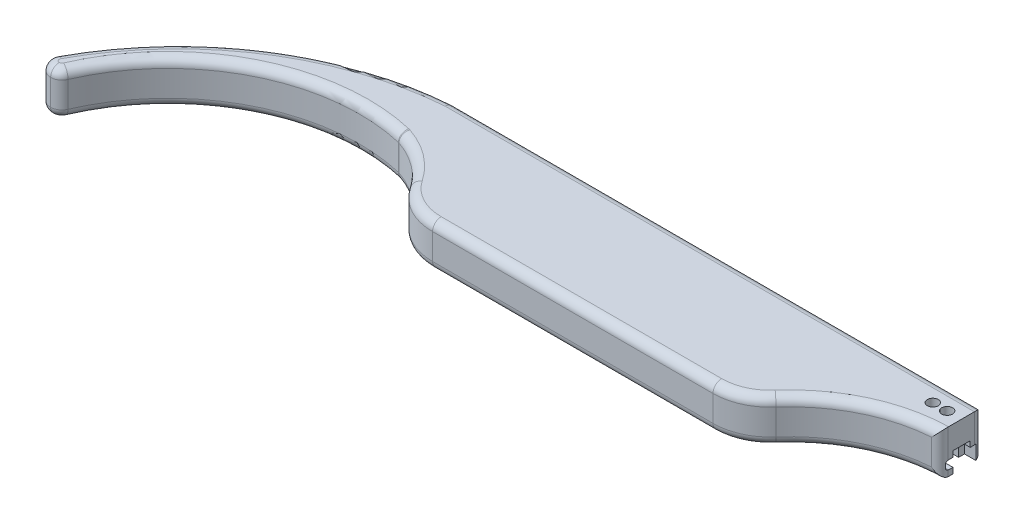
ISO-10303-21;
HEADER;
FILE_DESCRIPTION(('STEP AP214'),'2;1');
FILE_NAME('part.step','',(''),(''),'','','');
FILE_SCHEMA(('AUTOMOTIVE_DESIGN { 1 0 10303 214 1 1 1 1 }'));
ENDSEC;
DATA;
#1=APPLICATION_CONTEXT('core data for automotive mechanical design processes');
#2=APPLICATION_PROTOCOL_DEFINITION('international standard','automotive_design',2000,#1);
#3=PRODUCT_CONTEXT('',#1,'mechanical');
#4=PRODUCT('Part','Part','',(#3));
#5=PRODUCT_RELATED_PRODUCT_CATEGORY('part','',(#4));
#6=PRODUCT_DEFINITION_FORMATION('','',#4);
#7=PRODUCT_DEFINITION_CONTEXT('part definition',#1,'design');
#8=PRODUCT_DEFINITION('design','',#6,#7);
#9=PRODUCT_DEFINITION_SHAPE('','',#8);
#10=(LENGTH_UNIT() NAMED_UNIT(*) SI_UNIT(.MILLI.,.METRE.));
#11=(NAMED_UNIT(*) PLANE_ANGLE_UNIT() SI_UNIT($,.RADIAN.));
#12=(NAMED_UNIT(*) SI_UNIT($,.STERADIAN.) SOLID_ANGLE_UNIT());
#13=UNCERTAINTY_MEASURE_WITH_UNIT(LENGTH_MEASURE(1.E-05),#10,'distance_accuracy_value','');
#14=(GEOMETRIC_REPRESENTATION_CONTEXT(3) GLOBAL_UNCERTAINTY_ASSIGNED_CONTEXT((#13)) GLOBAL_UNIT_ASSIGNED_CONTEXT((#10,
#11,#12)) REPRESENTATION_CONTEXT('',''));
#15=CARTESIAN_POINT('',(0.,0.,0.));
#16=DIRECTION('',(0.,0.,1.));
#17=DIRECTION('',(1.,0.,0.));
#18=AXIS2_PLACEMENT_3D('',#15,#16,#17);
#19=CARTESIAN_POINT('',(-0.5,7.5,0.));
#20=DIRECTION('',(-1.,0.,0.));
#21=DIRECTION('',(0.,0.,1.));
#22=AXIS2_PLACEMENT_3D('',#19,#20,#21);
#23=PLANE('',#22);
#24=DIRECTION('',(0.,0.,-1.));
#25=VECTOR('',#24,1.);
#26=CARTESIAN_POINT('',(-0.5,0.,0.));
#27=LINE('',#26,#25);
#28=CARTESIAN_POINT('',(-0.499999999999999,0.,6.00446464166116));
#29=VERTEX_POINT('',#28);
#30=CARTESIAN_POINT('',(-0.5,0.,5.25));
#31=VERTEX_POINT('',#30);
#32=EDGE_CURVE('E288',#29,#31,#27,.T.);
#33=ORIENTED_EDGE('',*,*,#32,.T.);
#34=DIRECTION('',(0.,1.,0.));
#35=VECTOR('',#34,1.);
#36=CARTESIAN_POINT('',(-0.499999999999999,7.5,5.25));
#37=LINE('',#36,#35);
#38=CARTESIAN_POINT('',(-0.499999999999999,0.999999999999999,5.25));
#39=VERTEX_POINT('',#38);
#40=EDGE_CURVE('E400',#31,#39,#37,.T.);
#41=ORIENTED_EDGE('',*,*,#40,.T.);
#42=DIRECTION('',(0.,0.,-1.));
#43=VECTOR('',#42,1.);
#44=CARTESIAN_POINT('',(-0.5,0.999999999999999,4.5));
#45=LINE('',#44,#43);
#46=CARTESIAN_POINT('',(-0.499999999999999,0.999999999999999,6.));
#47=VERTEX_POINT('',#46);
#48=EDGE_CURVE('E921',#47,#39,#45,.T.);
#49=ORIENTED_EDGE('',*,*,#48,.F.);
#50=CARTESIAN_POINT('',(-0.499999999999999,1.5,6.));
#51=DIRECTION('',(-1.,0.,0.));
#52=DIRECTION('',(0.,0.,1.));
#53=AXIS2_PLACEMENT_3D('',#50,#51,#52);
#54=CIRCLE('',#53,0.5);
#55=CARTESIAN_POINT('',(-0.499999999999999,1.00161926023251,6.04020743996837));
#56=VERTEX_POINT('',#55);
#57=EDGE_CURVE('E603',#56,#47,#54,.F.);
#58=ORIENTED_EDGE('',*,*,#57,.F.);
#59=CARTESIAN_POINT('',(-0.499999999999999,1.5,6.));
#60=DIRECTION('',(-1.,0.,0.));
#61=DIRECTION('',(0.,0.,1.));
#62=AXIS2_PLACEMENT_3D('',#59,#60,#61);
#63=CIRCLE('',#62,0.5);
#64=CARTESIAN_POINT('',(-0.499999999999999,1.00514153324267,6.07151991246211));
#65=VERTEX_POINT('',#64);
#66=EDGE_CURVE('E483',#65,#56,#63,.F.);
#67=ORIENTED_EDGE('',*,*,#66,.F.);
#68=DIRECTION('',(0.,-1.,0.));
#69=VECTOR('',#68,1.);
#70=CARTESIAN_POINT('',(-0.499999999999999,7.5,6.07151991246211));
#71=LINE('',#70,#69);
#72=CARTESIAN_POINT('',(-0.499999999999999,0.00149907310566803,6.07151991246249));
#73=VERTEX_POINT('',#72);
#74=EDGE_CURVE('E899',#65,#73,#71,.T.);
#75=ORIENTED_EDGE('',*,*,#74,.T.);
#76=CARTESIAN_POINT('',(-0.499999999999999,1.5,7.50471740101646));
#77=CARTESIAN_POINT('',(-0.499999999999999,1.45780324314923,7.50471712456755));
#78=CARTESIAN_POINT('',(-0.499999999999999,1.41562670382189,7.50293540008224));
#79=CARTESIAN_POINT('',(-0.499999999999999,1.3315754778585,7.4958274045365));
#80=CARTESIAN_POINT('',(-0.499999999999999,1.28970077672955,7.49050130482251));
#81=CARTESIAN_POINT('',(-0.499999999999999,1.16505300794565,7.46925716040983));
#82=CARTESIAN_POINT('',(-0.499999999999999,1.08311495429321,7.44807312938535));
#83=CARTESIAN_POINT('',(-0.499999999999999,0.923960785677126,7.39225049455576));
#84=CARTESIAN_POINT('',(-0.499999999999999,0.846746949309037,7.35760545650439));
#85=CARTESIAN_POINT('',(-0.499999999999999,0.699233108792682,7.27584863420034));
#86=CARTESIAN_POINT('',(-0.499999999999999,0.628931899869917,7.22873902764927));
#87=CARTESIAN_POINT('',(-0.499999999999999,0.497232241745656,7.12338603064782));
#88=CARTESIAN_POINT('',(-0.499999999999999,0.435834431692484,7.06514184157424));
#89=CARTESIAN_POINT('',(-0.499999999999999,0.323673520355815,6.93916006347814));
#90=CARTESIAN_POINT('',(-0.499999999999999,0.272912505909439,6.87142061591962));
#91=CARTESIAN_POINT('',(-0.499999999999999,0.183466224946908,6.72836424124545));
#92=CARTESIAN_POINT('',(-0.499999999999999,0.14478533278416,6.65304458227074));
#93=CARTESIAN_POINT('',(-0.499999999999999,0.08063551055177,6.49699572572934));
#94=CARTESIAN_POINT('',(-0.499999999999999,0.0551588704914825,6.41626971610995));
#95=CARTESIAN_POINT('',(-0.499999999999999,0.0244633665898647,6.27995334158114));
#96=CARTESIAN_POINT('',(-0.499999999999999,0.0152951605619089,6.22521963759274));
#97=CARTESIAN_POINT('',(-0.499999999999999,0.00306427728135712,6.1151531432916));
#98=CARTESIAN_POINT('',(-0.499999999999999,-7.05206715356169E-06,6.05982131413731));
#99=CARTESIAN_POINT('',(-0.499999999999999,0.,6.00446464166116));
#100=B_SPLINE_CURVE_WITH_KNOTS('',3,(#76,#77,#78,#79,#80,#81,#82,#83,#84,#85,#86,#87,#88,#89,
#90,#91,#92,#93,#94,#95,#96,#97,#98,#99),.UNSPECIFIED.,.F.,.F.,(4,2,2,2,2,2,2,2,2,2,2,4),(0.,
0.126512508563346,0.253018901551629,0.50561312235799,0.758328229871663,1.01099921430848,
1.26368832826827,1.51642697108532,1.76925702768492,2.02193928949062,2.18811178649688,
2.35404829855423),.UNSPECIFIED.);
#101=EDGE_CURVE('E294',#73,#29,#100,.T.);
#102=ORIENTED_EDGE('',*,*,#101,.T.);
#103=EDGE_LOOP('',(#33,#41,#49,#58,#67,#75,#102));
#104=FACE_BOUND('',#103,.T.);
#105=ADVANCED_FACE('F58',(#104),#23,.F.);
#106=CARTESIAN_POINT('',(3.53553390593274,1.5,4.5));
#107=DIRECTION('',(-1.,0.,0.));
#108=DIRECTION('',(0.,0.,1.));
#109=AXIS2_PLACEMENT_3D('',#106,#107,#108);
#110=CYLINDRICAL_SURFACE('',#109,0.5);
#111=DIRECTION('',(-1.,0.,0.));
#112=VECTOR('',#111,1.);
#113=CARTESIAN_POINT('',(3.53553390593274,0.999999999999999,4.5));
#114=LINE('',#113,#112);
#115=CARTESIAN_POINT('',(-7.79903810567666,0.999999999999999,4.5));
#116=VERTEX_POINT('',#115);
#117=CARTESIAN_POINT('',(-26.3040366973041,0.999999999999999,4.5));
#118=VERTEX_POINT('',#117);
#119=EDGE_CURVE('E597',#116,#118,#114,.T.);
#120=ORIENTED_EDGE('',*,*,#119,.F.);
#121=CARTESIAN_POINT('',(-7.79903810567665,0.999999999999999,4.5));
#122=CARTESIAN_POINT('',(-7.81439438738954,0.999969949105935,4.47347458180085));
#123=CARTESIAN_POINT('',(-7.82890560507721,1.00211251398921,4.4463913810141));
#124=CARTESIAN_POINT('',(-7.8560291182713,1.0110427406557,4.39193793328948));
#125=CARTESIAN_POINT('',(-7.86863508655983,1.0178454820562,4.36456703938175));
#126=CARTESIAN_POINT('',(-7.89168468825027,1.03643905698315,4.31043713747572));
#127=CARTESIAN_POINT('',(-7.90211896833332,1.0482508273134,4.28368120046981));
#128=CARTESIAN_POINT('',(-7.92067179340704,1.07679108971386,4.23212012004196));
#129=CARTESIAN_POINT('',(-7.9287951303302,1.09350925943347,4.20731101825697));
#130=CARTESIAN_POINT('',(-7.94228118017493,1.12988015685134,4.16270308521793));
#131=CARTESIAN_POINT('',(-7.94781867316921,1.14916756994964,4.14265832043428));
#132=CARTESIAN_POINT('',(-7.95729335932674,1.19104468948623,4.10588966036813));
#133=CARTESIAN_POINT('',(-7.96122974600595,1.21363605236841,4.0891674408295));
#134=CARTESIAN_POINT('',(-7.96765853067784,1.26068291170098,4.06015037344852));
#135=CARTESIAN_POINT('',(-7.97019253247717,1.28505720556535,4.04773258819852));
#136=CARTESIAN_POINT('',(-7.97423531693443,1.33556982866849,4.02702357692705));
#137=CARTESIAN_POINT('',(-7.97574474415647,1.36170703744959,4.01872975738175));
#138=CARTESIAN_POINT('',(-7.97757596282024,1.40664652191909,4.00843287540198));
#139=CARTESIAN_POINT('',(-7.97812161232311,1.4251838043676,4.00527331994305));
#140=CARTESIAN_POINT('',(-7.97884135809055,1.462478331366,4.00105661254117));
#141=CARTESIAN_POINT('',(-7.97901594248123,1.48123525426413,3.99999669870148));
#142=CARTESIAN_POINT('',(-7.9790199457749,1.5,4.));
#143=B_SPLINE_CURVE_WITH_KNOTS('',3,(#121,#122,#123,#124,#125,#126,#127,#128,#129,#130,#131,
#132,#133,#134,#135,#136,#137,#138,#139,#140,#141,#142),.UNSPECIFIED.,.F.,.F.,(4,2,2,2,2,2,2,2,
2,2,4),(0.,0.0919487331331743,0.1841964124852,0.27683353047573,0.369277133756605,
0.453941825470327,0.538649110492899,0.620686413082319,0.7026720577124,0.758994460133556,
0.815242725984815),.UNSPECIFIED.);
#144=CARTESIAN_POINT('',(-7.9790199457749,1.5,4.));
#145=VERTEX_POINT('',#144);
#146=EDGE_CURVE('E630',#116,#145,#143,.T.);
#147=ORIENTED_EDGE('',*,*,#146,.T.);
#148=DIRECTION('',(-1.,0.,0.));
#149=VECTOR('',#148,1.);
#150=CARTESIAN_POINT('',(3.53553390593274,1.5,4.));
#151=LINE('',#150,#149);
#152=CARTESIAN_POINT('',(-26.3040366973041,1.5,4.));
#153=VERTEX_POINT('',#152);
#154=EDGE_CURVE('E601',#145,#153,#151,.T.);
#155=ORIENTED_EDGE('',*,*,#154,.T.);
#156=CARTESIAN_POINT('',(-26.3040366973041,1.5,4.5));
#157=DIRECTION('',(-1.,0.,0.));
#158=DIRECTION('',(0.,0.,1.));
#159=AXIS2_PLACEMENT_3D('',#156,#157,#158);
#160=CIRCLE('',#159,0.5);
#161=EDGE_CURVE('E208',#153,#118,#160,.T.);
#162=ORIENTED_EDGE('',*,*,#161,.T.);
#163=EDGE_LOOP('',(#120,#147,#155,#162));
#164=FACE_BOUND('',#163,.T.);
#165=ADVANCED_FACE('F384',(#164),#110,.F.);
#166=CARTESIAN_POINT('',(3.53553390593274,2.,4.5));
#167=DIRECTION('',(-1.,0.,0.));
#168=DIRECTION('',(0.,0.,1.));
#169=AXIS2_PLACEMENT_3D('',#166,#167,#168);
#170=CYLINDRICAL_SURFACE('',#169,0.5);
#171=DIRECTION('',(-1.,0.,0.));
#172=VECTOR('',#171,1.);
#173=CARTESIAN_POINT('',(3.53553390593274,2.,4.));
#174=LINE('',#173,#172);
#175=CARTESIAN_POINT('',(-7.9790199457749,2.,4.));
#176=VERTEX_POINT('',#175);
#177=CARTESIAN_POINT('',(-26.3040366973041,2.,4.));
#178=VERTEX_POINT('',#177);
#179=EDGE_CURVE('E604',#176,#178,#174,.T.);
#180=ORIENTED_EDGE('',*,*,#179,.F.);
#181=CARTESIAN_POINT('',(-7.9790199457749,2.,4.));
#182=CARTESIAN_POINT('',(-7.97900223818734,2.02764035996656,3.99997423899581));
#183=CARTESIAN_POINT('',(-7.97863238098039,2.05527585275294,4.00229045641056));
#184=CARTESIAN_POINT('',(-7.97705711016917,2.10975508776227,4.0114211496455));
#185=CARTESIAN_POINT('',(-7.97585212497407,2.13659922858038,4.0182333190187));
#186=CARTESIAN_POINT('',(-7.97247449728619,2.18876056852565,4.03617638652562));
#187=CARTESIAN_POINT('',(-7.9703012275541,2.21407676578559,4.04731008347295));
#188=CARTESIAN_POINT('',(-7.96475784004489,2.26242907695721,4.07351861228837));
#189=CARTESIAN_POINT('',(-7.96138802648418,2.28546576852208,4.0885924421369));
#190=CARTESIAN_POINT('',(-7.95322537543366,2.32848252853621,4.1220613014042));
#191=CARTESIAN_POINT('',(-7.94844080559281,2.34847936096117,4.14043679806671));
#192=CARTESIAN_POINT('',(-7.93722448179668,2.38503557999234,4.17988987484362));
#193=CARTESIAN_POINT('',(-7.93079329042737,2.40159613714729,4.20096653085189));
#194=CARTESIAN_POINT('',(-7.91616767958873,2.43088438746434,4.24497915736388));
#195=CARTESIAN_POINT('',(-7.90797832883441,2.44362285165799,4.26790966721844));
#196=CARTESIAN_POINT('',(-7.88979509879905,2.46519354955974,4.31489403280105));
#197=CARTESIAN_POINT('',(-7.87979918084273,2.47402133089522,4.33894913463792));
#198=CARTESIAN_POINT('',(-7.85869408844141,2.48742758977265,4.38606392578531));
#199=CARTESIAN_POINT('',(-7.84767454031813,2.4922103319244,4.40910695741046));
#200=CARTESIAN_POINT('',(-7.82431113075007,2.49849832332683,4.45489176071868));
#201=CARTESIAN_POINT('',(-7.81197100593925,2.50001257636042,4.47763418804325));
#202=CARTESIAN_POINT('',(-7.79903810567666,2.5,4.5));
#203=B_SPLINE_CURVE_WITH_KNOTS('',3,(#181,#182,#183,#184,#185,#186,#187,#188,#189,#190,#191,
#192,#193,#194,#195,#196,#197,#198,#199,#200,#201,#202),.UNSPECIFIED.,.F.,.F.,(4,2,2,2,2,2,2,2,
2,2,4),(0.,0.0828151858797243,0.16558792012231,0.248414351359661,0.331219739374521,
0.413550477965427,0.495853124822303,0.577921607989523,0.66008328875,0.737794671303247,
0.815291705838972),.UNSPECIFIED.);
#204=CARTESIAN_POINT('',(-7.79903810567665,2.5,4.5));
#205=VERTEX_POINT('',#204);
#206=EDGE_CURVE('E657',#176,#205,#203,.T.);
#207=ORIENTED_EDGE('',*,*,#206,.T.);
#208=DIRECTION('',(-1.,0.,0.));
#209=VECTOR('',#208,1.);
#210=CARTESIAN_POINT('',(3.53553390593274,2.5,4.5));
#211=LINE('',#210,#209);
#212=CARTESIAN_POINT('',(-26.3040366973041,2.5,4.5));
#213=VERTEX_POINT('',#212);
#214=EDGE_CURVE('E914',#205,#213,#211,.T.);
#215=ORIENTED_EDGE('',*,*,#214,.T.);
#216=CARTESIAN_POINT('',(-26.3040366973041,2.,4.5));
#217=DIRECTION('',(-1.,0.,0.));
#218=DIRECTION('',(0.,0.,1.));
#219=AXIS2_PLACEMENT_3D('',#216,#217,#218);
#220=CIRCLE('',#219,0.5);
#221=EDGE_CURVE('E1422',#213,#178,#220,.T.);
#222=ORIENTED_EDGE('',*,*,#221,.T.);
#223=EDGE_LOOP('',(#180,#207,#215,#222));
#224=FACE_BOUND('',#223,.T.);
#225=ADVANCED_FACE('F391',(#224),#170,.F.);
#226=CARTESIAN_POINT('',(-26.3040366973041,6.,16.7113265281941));
#227=DIRECTION('',(1.,0.,0.));
#228=DIRECTION('',(0.,0.,-1.));
#229=AXIS2_PLACEMENT_3D('',#226,#227,#228);
#230=PLANE('',#229);
#231=DIRECTION('',(0.,0.,1.));
#232=VECTOR('',#231,1.);
#233=CARTESIAN_POINT('',(-26.3040366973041,0.999999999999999,4.5));
#234=LINE('',#233,#232);
#235=CARTESIAN_POINT('',(-26.3040366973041,1.,6.));
#236=VERTEX_POINT('',#235);
#237=EDGE_CURVE('E1405',#118,#236,#234,.T.);
#238=ORIENTED_EDGE('',*,*,#237,.F.);
#239=ORIENTED_EDGE('',*,*,#161,.F.);
#240=DIRECTION('',(0.,-1.,0.));
#241=VECTOR('',#240,1.);
#242=CARTESIAN_POINT('',(-26.3040366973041,3.,4.));
#243=LINE('',#242,#241);
#244=EDGE_CURVE('E600',#178,#153,#243,.T.);
#245=ORIENTED_EDGE('',*,*,#244,.F.);
#246=ORIENTED_EDGE('',*,*,#221,.F.);
#247=DIRECTION('',(0.,0.,-1.));
#248=VECTOR('',#247,1.);
#249=CARTESIAN_POINT('',(-26.3040366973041,2.5,4.5));
#250=LINE('',#249,#248);
#251=CARTESIAN_POINT('',(-26.3040366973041,2.5,6.));
#252=VERTEX_POINT('',#251);
#253=EDGE_CURVE('E1419',#252,#213,#250,.T.);
#254=ORIENTED_EDGE('',*,*,#253,.F.);
#255=CARTESIAN_POINT('',(-26.3040366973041,2.,6.));
#256=DIRECTION('',(-1.,0.,0.));
#257=DIRECTION('',(0.,0.,-1.));
#258=AXIS2_PLACEMENT_3D('',#255,#256,#257);
#259=CIRCLE('',#258,0.5);
#260=CARTESIAN_POINT('',(-26.3040366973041,2.,6.5));
#261=VERTEX_POINT('',#260);
#262=EDGE_CURVE('E1416',#261,#252,#259,.T.);
#263=ORIENTED_EDGE('',*,*,#262,.F.);
#264=DIRECTION('',(0.,1.,0.));
#265=VECTOR('',#264,1.);
#266=CARTESIAN_POINT('',(-26.3040366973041,3.,6.5));
#267=LINE('',#266,#265);
#268=CARTESIAN_POINT('',(-26.3040366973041,1.5,6.5));
#269=VERTEX_POINT('',#268);
#270=EDGE_CURVE('E1413',#269,#261,#267,.T.);
#271=ORIENTED_EDGE('',*,*,#270,.F.);
#272=CARTESIAN_POINT('',(-26.3040366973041,1.5,6.));
#273=DIRECTION('',(-1.,0.,0.));
#274=DIRECTION('',(0.,0.,1.));
#275=AXIS2_PLACEMENT_3D('',#272,#273,#274);
#276=CIRCLE('',#275,0.5);
#277=EDGE_CURVE('E1409',#236,#269,#276,.T.);
#278=ORIENTED_EDGE('',*,*,#277,.F.);
#279=EDGE_LOOP('',(#238,#239,#245,#246,#254,#263,#271,#278));
#280=FACE_BOUND('',#279,.T.);
#281=DIRECTION('',(0.,1.,0.));
#282=VECTOR('',#281,1.);
#283=CARTESIAN_POINT('',(-26.3040366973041,-33.0147027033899,3.71132652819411));
#284=LINE('',#283,#282);
#285=CARTESIAN_POINT('',(-26.3040366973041,1.,3.71132652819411));
#286=VERTEX_POINT('',#285);
#287=CARTESIAN_POINT('',(-26.3040366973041,6.5,3.71132652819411));
#288=VERTEX_POINT('',#287);
#289=EDGE_CURVE('E178',#286,#288,#284,.T.);
#290=ORIENTED_EDGE('',*,*,#289,.F.);
#291=DIRECTION('',(0.,0.,1.));
#292=VECTOR('',#291,1.);
#293=CARTESIAN_POINT('',(-26.3040366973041,1.,2.71132652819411));
#294=LINE('',#293,#292);
#295=CARTESIAN_POINT('',(-26.3040366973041,1.,2.71132652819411));
#296=VERTEX_POINT('',#295);
#297=EDGE_CURVE('E184',#296,#286,#294,.T.);
#298=ORIENTED_EDGE('',*,*,#297,.F.);
#299=DIRECTION('',(0.,-1.,0.));
#300=VECTOR('',#299,1.);
#301=CARTESIAN_POINT('',(-26.3040366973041,6.,2.71132652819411));
#302=LINE('',#301,#300);
#303=CARTESIAN_POINT('',(-26.3040366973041,0.,2.71132652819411));
#304=VERTEX_POINT('',#303);
#305=EDGE_CURVE('E227',#296,#304,#302,.T.);
#306=ORIENTED_EDGE('',*,*,#305,.T.);
#307=DIRECTION('',(0.,0.,1.));
#308=VECTOR('',#307,1.);
#309=CARTESIAN_POINT('',(-26.3040366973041,0.,16.7113265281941));
#310=LINE('',#309,#308);
#311=CARTESIAN_POINT('',(-26.3040366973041,0.,7.21132652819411));
#312=VERTEX_POINT('',#311);
#313=EDGE_CURVE('E232',#304,#312,#310,.T.);
#314=ORIENTED_EDGE('',*,*,#313,.T.);
#315=DIRECTION('',(0.,-1.,0.));
#316=VECTOR('',#315,1.);
#317=CARTESIAN_POINT('',(-26.3040366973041,1.,7.21132652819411));
#318=LINE('',#317,#316);
#319=CARTESIAN_POINT('',(-26.3040366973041,1.,7.2113265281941));
#320=VERTEX_POINT('',#319);
#321=EDGE_CURVE('E238',#320,#312,#318,.T.);
#322=ORIENTED_EDGE('',*,*,#321,.F.);
#323=DIRECTION('',(0.,0.,-1.));
#324=VECTOR('',#323,1.);
#325=CARTESIAN_POINT('',(-26.3040366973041,1.,0.));
#326=LINE('',#325,#324);
#327=CARTESIAN_POINT('',(-26.3040366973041,1.,12.2113265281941));
#328=VERTEX_POINT('',#327);
#329=EDGE_CURVE('E240',#328,#320,#326,.T.);
#330=ORIENTED_EDGE('',*,*,#329,.F.);
#331=DIRECTION('',(0.,-1.,0.));
#332=VECTOR('',#331,1.);
#333=CARTESIAN_POINT('',(-26.3040366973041,1.,12.2113265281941));
#334=LINE('',#333,#332);
#335=CARTESIAN_POINT('',(-26.3040366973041,0.,12.2113265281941));
#336=VERTEX_POINT('',#335);
#337=EDGE_CURVE('E234',#328,#336,#334,.T.);
#338=ORIENTED_EDGE('',*,*,#337,.T.);
#339=DIRECTION('',(0.,0.,1.));
#340=VECTOR('',#339,1.);
#341=CARTESIAN_POINT('',(-26.3040366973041,0.,16.7113265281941));
#342=LINE('',#341,#340);
#343=CARTESIAN_POINT('',(-26.3040366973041,0.,16.7113265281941));
#344=VERTEX_POINT('',#343);
#345=EDGE_CURVE('E228',#336,#344,#342,.T.);
#346=ORIENTED_EDGE('',*,*,#345,.T.);
#347=DIRECTION('',(0.,-1.,0.));
#348=VECTOR('',#347,1.);
#349=CARTESIAN_POINT('',(-26.3040366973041,6.,16.7113265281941));
#350=LINE('',#349,#348);
#351=CARTESIAN_POINT('',(-26.3040366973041,1.,16.7113265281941));
#352=VERTEX_POINT('',#351);
#353=EDGE_CURVE('E223',#352,#344,#350,.T.);
#354=ORIENTED_EDGE('',*,*,#353,.F.);
#355=DIRECTION('',(0.,0.,1.));
#356=VECTOR('',#355,1.);
#357=CARTESIAN_POINT('',(-26.3040366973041,1.,16.7113265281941));
#358=LINE('',#357,#356);
#359=CARTESIAN_POINT('',(-26.3040366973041,1.,15.7113265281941));
#360=VERTEX_POINT('',#359);
#361=EDGE_CURVE('E218',#360,#352,#358,.T.);
#362=ORIENTED_EDGE('',*,*,#361,.F.);
#363=DIRECTION('',(0.,1.,0.));
#364=VECTOR('',#363,1.);
#365=CARTESIAN_POINT('',(-26.3040366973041,-33.0147027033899,15.7113265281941));
#366=LINE('',#365,#364);
#367=CARTESIAN_POINT('',(-26.3040366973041,6.5,15.7113265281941));
#368=VERTEX_POINT('',#367);
#369=EDGE_CURVE('E214',#360,#368,#366,.T.);
#370=ORIENTED_EDGE('',*,*,#369,.T.);
#371=DIRECTION('',(0.,0.,1.));
#372=VECTOR('',#371,1.);
#373=CARTESIAN_POINT('',(-26.3040366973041,6.5,0.));
#374=LINE('',#373,#372);
#375=EDGE_CURVE('E195',#288,#368,#374,.T.);
#376=ORIENTED_EDGE('',*,*,#375,.F.);
#377=EDGE_LOOP('',(#290,#298,#306,#314,#322,#330,#338,#346,#354,#362,#370,#376));
#378=FACE_BOUND('',#377,.T.);
#379=ADVANCED_FACE('F193',(#280,#378),#230,.F.);
#380=CARTESIAN_POINT('',(-76.3040366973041,6.,16.7113265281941));
#381=DIRECTION('',(-1.,0.,0.));
#382=DIRECTION('',(0.,0.,1.));
#383=AXIS2_PLACEMENT_3D('',#380,#381,#382);
#384=PLANE('',#383);
#385=DIRECTION('',(0.,1.,0.));
#386=VECTOR('',#385,1.);
#387=CARTESIAN_POINT('',(-76.3040366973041,-33.0147027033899,3.71132652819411));
#388=LINE('',#387,#386);
#389=CARTESIAN_POINT('',(-76.3040366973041,1.,3.71132652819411));
#390=VERTEX_POINT('',#389);
#391=CARTESIAN_POINT('',(-76.3040366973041,6.5,3.71132652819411));
#392=VERTEX_POINT('',#391);
#393=EDGE_CURVE('E181',#390,#392,#388,.T.);
#394=ORIENTED_EDGE('',*,*,#393,.T.);
#395=DIRECTION('',(0.,0.,-1.));
#396=VECTOR('',#395,1.);
#397=CARTESIAN_POINT('',(-76.3040366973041,6.5,0.));
#398=LINE('',#397,#396);
#399=CARTESIAN_POINT('',(-76.3040366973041,6.5,15.7113265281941));
#400=VERTEX_POINT('',#399);
#401=EDGE_CURVE('E213',#400,#392,#398,.T.);
#402=ORIENTED_EDGE('',*,*,#401,.F.);
#403=DIRECTION('',(0.,1.,0.));
#404=VECTOR('',#403,1.);
#405=CARTESIAN_POINT('',(-76.3040366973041,-33.0147027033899,15.7113265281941));
#406=LINE('',#405,#404);
#407=CARTESIAN_POINT('',(-76.3040366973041,1.,15.7113265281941));
#408=VERTEX_POINT('',#407);
#409=EDGE_CURVE('E197',#408,#400,#406,.T.);
#410=ORIENTED_EDGE('',*,*,#409,.F.);
#411=DIRECTION('',(0.,0.,-1.));
#412=VECTOR('',#411,1.);
#413=CARTESIAN_POINT('',(-76.3040366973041,1.,16.7113265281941));
#414=LINE('',#413,#412);
#415=CARTESIAN_POINT('',(-76.3040366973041,1.,16.7113265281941));
#416=VERTEX_POINT('',#415);
#417=EDGE_CURVE('E1523',#416,#408,#414,.T.);
#418=ORIENTED_EDGE('',*,*,#417,.F.);
#419=DIRECTION('',(0.,-1.,0.));
#420=VECTOR('',#419,1.);
#421=CARTESIAN_POINT('',(-76.3040366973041,6.,16.7113265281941));
#422=LINE('',#421,#420);
#423=CARTESIAN_POINT('',(-76.3040366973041,0.,16.7113265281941));
#424=VERTEX_POINT('',#423);
#425=EDGE_CURVE('E226',#416,#424,#422,.T.);
#426=ORIENTED_EDGE('',*,*,#425,.T.);
#427=DIRECTION('',(0.,0.,-1.));
#428=VECTOR('',#427,1.);
#429=CARTESIAN_POINT('',(-76.3040366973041,0.,16.7113265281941));
#430=LINE('',#429,#428);
#431=CARTESIAN_POINT('',(-76.3040366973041,0.,12.2113265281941));
#432=VERTEX_POINT('',#431);
#433=EDGE_CURVE('E940',#424,#432,#430,.T.);
#434=ORIENTED_EDGE('',*,*,#433,.T.);
#435=DIRECTION('',(0.,-1.,0.));
#436=VECTOR('',#435,1.);
#437=CARTESIAN_POINT('',(-76.3040366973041,1.,12.2113265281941));
#438=LINE('',#437,#436);
#439=CARTESIAN_POINT('',(-76.3040366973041,1.,12.2113265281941));
#440=VERTEX_POINT('',#439);
#441=EDGE_CURVE('E1348',#440,#432,#438,.T.);
#442=ORIENTED_EDGE('',*,*,#441,.F.);
#443=DIRECTION('',(0.,0.,1.));
#444=VECTOR('',#443,1.);
#445=CARTESIAN_POINT('',(-76.3040366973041,1.,0.));
#446=LINE('',#445,#444);
#447=CARTESIAN_POINT('',(-76.3040366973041,1.,7.21132652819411));
#448=VERTEX_POINT('',#447);
#449=EDGE_CURVE('E1344',#448,#440,#446,.T.);
#450=ORIENTED_EDGE('',*,*,#449,.F.);
#451=DIRECTION('',(0.,-1.,0.));
#452=VECTOR('',#451,1.);
#453=CARTESIAN_POINT('',(-76.3040366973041,1.,7.21132652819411));
#454=LINE('',#453,#452);
#455=CARTESIAN_POINT('',(-76.3040366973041,0.,7.21132652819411));
#456=VERTEX_POINT('',#455);
#457=EDGE_CURVE('E1350',#448,#456,#454,.T.);
#458=ORIENTED_EDGE('',*,*,#457,.T.);
#459=CARTESIAN_POINT('',(-76.3040366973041,0.,2.71132652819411));
#460=VERTEX_POINT('',#459);
#461=EDGE_CURVE('E934',#456,#460,#430,.T.);
#462=ORIENTED_EDGE('',*,*,#461,.T.);
#463=DIRECTION('',(0.,-1.,0.));
#464=VECTOR('',#463,1.);
#465=CARTESIAN_POINT('',(-76.3040366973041,6.,2.71132652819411));
#466=LINE('',#465,#464);
#467=CARTESIAN_POINT('',(-76.3040366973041,1.,2.71132652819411));
#468=VERTEX_POINT('',#467);
#469=EDGE_CURVE('E212',#468,#460,#466,.T.);
#470=ORIENTED_EDGE('',*,*,#469,.F.);
#471=DIRECTION('',(0.,0.,-1.));
#472=VECTOR('',#471,1.);
#473=CARTESIAN_POINT('',(-76.3040366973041,1.,2.71132652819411));
#474=LINE('',#473,#472);
#475=EDGE_CURVE('E1515',#390,#468,#474,.T.);
#476=ORIENTED_EDGE('',*,*,#475,.F.);
#477=EDGE_LOOP('',(#394,#402,#410,#418,#426,#434,#442,#450,#458,#462,#470,#476));
#478=FACE_BOUND('',#477,.T.);
#479=ADVANCED_FACE('F685',(#478),#384,.F.);
#480=CARTESIAN_POINT('',(0.,6.5,0.));
#481=DIRECTION('',(0.,-1.,0.));
#482=DIRECTION('',(0.,0.,-1.));
#483=AXIS2_PLACEMENT_3D('',#480,#481,#482);
#484=PLANE('',#483);
#485=ORIENTED_EDGE('',*,*,#401,.T.);
#486=DIRECTION('',(-1.,0.,0.));
#487=VECTOR('',#486,1.);
#488=CARTESIAN_POINT('',(-76.3040366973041,6.5,3.71132652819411));
#489=LINE('',#488,#487);
#490=EDGE_CURVE('E198',#288,#392,#489,.T.);
#491=ORIENTED_EDGE('',*,*,#490,.F.);
#492=ORIENTED_EDGE('',*,*,#375,.T.);
#493=DIRECTION('',(1.,0.,0.));
#494=VECTOR('',#493,1.);
#495=CARTESIAN_POINT('',(-76.3040366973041,6.5,15.7113265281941));
#496=LINE('',#495,#494);
#497=EDGE_CURVE('E203',#400,#368,#496,.T.);
#498=ORIENTED_EDGE('',*,*,#497,.F.);
#499=EDGE_LOOP('',(#485,#491,#492,#498));
#500=FACE_BOUND('',#499,.T.);
#501=ADVANCED_FACE('F740',(#500),#484,.T.);
#502=CARTESIAN_POINT('',(0.,0.,34.));
#503=DIRECTION('',(0.,1.,0.));
#504=DIRECTION('',(0.,0.,1.));
#505=AXIS2_PLACEMENT_3D('',#502,#503,#504);
#506=PLANE('',#505);
#507=DIRECTION('',(-1.,0.,0.));
#508=VECTOR('',#507,1.);
#509=CARTESIAN_POINT('',(0.,0.,1.49999999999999));
#510=LINE('',#509,#508);
#511=CARTESIAN_POINT('',(-92.5946307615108,0.,1.5));
#512=VERTEX_POINT('',#511);
#513=CARTESIAN_POINT('',(-2.5,0.,1.49999999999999));
#514=VERTEX_POINT('',#513);
#515=EDGE_CURVE('E445',#512,#514,#510,.F.);
#516=ORIENTED_EDGE('',*,*,#515,.T.);
#517=DIRECTION('',(0.,0.,-1.));
#518=VECTOR('',#517,1.);
#519=CARTESIAN_POINT('',(-2.5,0.,2.25));
#520=LINE('',#519,#518);
#521=CARTESIAN_POINT('',(-2.5,0.,2.25));
#522=VERTEX_POINT('',#521);
#523=EDGE_CURVE('E814',#522,#514,#520,.T.);
#524=ORIENTED_EDGE('',*,*,#523,.F.);
#525=DIRECTION('',(1.,0.,0.));
#526=VECTOR('',#525,1.);
#527=CARTESIAN_POINT('',(-6.5,0.,2.25));
#528=LINE('',#527,#526);
#529=CARTESIAN_POINT('',(-6.5,0.,2.25));
#530=VERTEX_POINT('',#529);
#531=EDGE_CURVE('E1570',#530,#522,#528,.T.);
#532=ORIENTED_EDGE('',*,*,#531,.F.);
#533=CARTESIAN_POINT('',(-6.5,0.,3.75));
#534=DIRECTION('',(0.,-1.,0.));
#535=DIRECTION('',(0.,0.,1.));
#536=AXIS2_PLACEMENT_3D('',#533,#534,#535);
#537=CIRCLE('',#536,1.5);
#538=CARTESIAN_POINT('',(-6.5,0.,5.25));
#539=VERTEX_POINT('',#538);
#540=EDGE_CURVE('E1478',#539,#530,#537,.T.);
#541=ORIENTED_EDGE('',*,*,#540,.F.);
#542=DIRECTION('',(-1.,0.,0.));
#543=VECTOR('',#542,1.);
#544=CARTESIAN_POINT('',(0.487974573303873,0.,5.25));
#545=LINE('',#544,#543);
#546=EDGE_CURVE('E419',#31,#539,#545,.T.);
#547=ORIENTED_EDGE('',*,*,#546,.F.);
#548=ORIENTED_EDGE('',*,*,#32,.F.);
#549=CARTESIAN_POINT('',(0.,0.,34.));
#550=DIRECTION('',(0.,1.,0.));
#551=DIRECTION('',(0.,0.,1.));
#552=AXIS2_PLACEMENT_3D('',#549,#550,#551);
#553=CIRCLE('',#552,28.);
#554=CARTESIAN_POINT('',(-21.0958904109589,0.,15.5890410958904));
#555=VERTEX_POINT('',#554);
#556=EDGE_CURVE('E416',#29,#555,#553,.T.);
#557=ORIENTED_EDGE('',*,*,#556,.T.);
#558=CARTESIAN_POINT('',(-27.5,0.,10.));
#559=DIRECTION('',(0.,1.,0.));
#560=DIRECTION('',(0.,0.,1.));
#561=AXIS2_PLACEMENT_3D('',#558,#559,#560);
#562=CIRCLE('',#561,8.5);
#563=CARTESIAN_POINT('',(-27.5,0.,18.5));
#564=VERTEX_POINT('',#563);
#565=EDGE_CURVE('E427',#555,#564,#562,.F.);
#566=ORIENTED_EDGE('',*,*,#565,.T.);
#567=DIRECTION('',(1.,0.,0.));
#568=VECTOR('',#567,1.);
#569=CARTESIAN_POINT('',(0.,0.,18.5));
#570=LINE('',#569,#568);
#571=CARTESIAN_POINT('',(-76.3040366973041,0.,18.5));
#572=VERTEX_POINT('',#571);
#573=EDGE_CURVE('E432',#564,#572,#570,.F.);
#574=ORIENTED_EDGE('',*,*,#573,.T.);
#575=CARTESIAN_POINT('',(-76.3040366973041,0.,10.));
#576=DIRECTION('',(0.,1.,0.));
#577=DIRECTION('',(0.,0.,1.));
#578=AXIS2_PLACEMENT_3D('',#575,#576,#577);
#579=CIRCLE('',#578,8.5);
#580=CARTESIAN_POINT('',(-83.3320888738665,0.,14.7808453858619));
#581=VERTEX_POINT('',#580);
#582=EDGE_CURVE('E444',#572,#581,#579,.F.);
#583=ORIENTED_EDGE('',*,*,#582,.T.);
#584=CARTESIAN_POINT('',(-97.5352566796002,0.,24.4425763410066));
#585=DIRECTION('',(0.,1.,0.));
#586=DIRECTION('',(0.,0.,1.));
#587=AXIS2_PLACEMENT_3D('',#584,#585,#586);
#588=CIRCLE('',#587,17.1778642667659);
#589=CARTESIAN_POINT('',(-92.1103010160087,0.,8.14383783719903));
#590=VERTEX_POINT('',#589);
#591=EDGE_CURVE('E526',#581,#590,#588,.T.);
#592=ORIENTED_EDGE('',*,*,#591,.T.);
#593=CARTESIAN_POINT('',(-93.0577335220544,0.,10.9903043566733));
#594=DIRECTION('',(0.,1.,0.));
#595=DIRECTION('',(0.,0.,1.));
#596=AXIS2_PLACEMENT_3D('',#593,#594,#595);
#597=CIRCLE('',#596,3.);
#598=CARTESIAN_POINT('',(-92.372188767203,0.,8.06968312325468));
#599=VERTEX_POINT('',#598);
#600=EDGE_CURVE('E530',#599,#590,#597,.F.);
#601=ORIENTED_EDGE('',*,*,#600,.F.);
#602=CARTESIAN_POINT('',(-100.336125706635,0.,41.9983845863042));
#603=DIRECTION('',(0.,1.,0.));
#604=DIRECTION('',(0.,0.,1.));
#605=AXIS2_PLACEMENT_3D('',#602,#603,#604);
#606=CIRCLE('',#605,34.8508403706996);
#607=CARTESIAN_POINT('',(-132.338160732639,0.,28.1979922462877));
#608=VERTEX_POINT('',#607);
#609=EDGE_CURVE('E534',#599,#608,#606,.T.);
#610=ORIENTED_EDGE('',*,*,#609,.T.);
#611=CARTESIAN_POINT('',(-132.797289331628,0.,28.));
#612=DIRECTION('',(0.,1.,0.));
#613=DIRECTION('',(0.,0.,1.));
#614=AXIS2_PLACEMENT_3D('',#611,#612,#613);
#615=CIRCLE('',#614,0.5);
#616=CARTESIAN_POINT('',(-132.778120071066,0.,28.4996324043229));
#617=VERTEX_POINT('',#616);
#618=EDGE_CURVE('E538',#608,#617,#615,.F.);
#619=ORIENTED_EDGE('',*,*,#618,.T.);
#620=CARTESIAN_POINT('',(-132.758950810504,0.,28.));
#621=DIRECTION('',(0.,1.,0.));
#622=DIRECTION('',(0.,0.,1.));
#623=AXIS2_PLACEMENT_3D('',#620,#621,#622);
#624=CIRCLE('',#623,0.5);
#625=CARTESIAN_POINT('',(-133.198616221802,0.,27.7618942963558));
#626=VERTEX_POINT('',#625);
#627=EDGE_CURVE('E542',#617,#626,#624,.F.);
#628=ORIENTED_EDGE('',*,*,#627,.T.);
#629=CARTESIAN_POINT('',(-88.8803427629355,0.,51.762949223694));
#630=DIRECTION('',(0.,1.,0.));
#631=DIRECTION('',(0.,0.,1.));
#632=AXIS2_PLACEMENT_3D('',#629,#630,#631);
#633=CIRCLE('',#632,50.4);
#634=EDGE_CURVE('E449',#626,#512,#633,.F.);
#635=ORIENTED_EDGE('',*,*,#634,.T.);
#636=EDGE_LOOP('',(#516,#524,#532,#541,#547,#548,#557,#566,#574,#583,#592,#601,#610,#619,#628,#635));
#637=FACE_BOUND('',#636,.T.);
#638=ORIENTED_EDGE('',*,*,#461,.F.);
#639=DIRECTION('',(1.,0.,0.));
#640=VECTOR('',#639,1.);
#641=CARTESIAN_POINT('',(0.,0.,7.21132652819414));
#642=LINE('',#641,#640);
#643=CARTESIAN_POINT('',(-78.8040366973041,0.,7.21132652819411));
#644=VERTEX_POINT('',#643);
#645=EDGE_CURVE('E1352',#644,#456,#642,.T.);
#646=ORIENTED_EDGE('',*,*,#645,.F.);
#647=CARTESIAN_POINT('',(-78.8040366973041,0.,9.71132652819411));
#648=DIRECTION('',(0.,-1.,0.));
#649=DIRECTION('',(0.,0.,-1.));
#650=AXIS2_PLACEMENT_3D('',#647,#648,#649);
#651=CIRCLE('',#650,2.49999999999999);
#652=CARTESIAN_POINT('',(-78.8040366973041,0.,12.2113265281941));
#653=VERTEX_POINT('',#652);
#654=EDGE_CURVE('E1362',#644,#653,#651,.F.);
#655=ORIENTED_EDGE('',*,*,#654,.T.);
#656=DIRECTION('',(1.,0.,0.));
#657=VECTOR('',#656,1.);
#658=CARTESIAN_POINT('',(0.,0.,12.2113265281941));
#659=LINE('',#658,#657);
#660=EDGE_CURVE('E1368',#653,#432,#659,.T.);
#661=ORIENTED_EDGE('',*,*,#660,.T.);
#662=ORIENTED_EDGE('',*,*,#433,.F.);
#663=DIRECTION('',(-1.,0.,0.));
#664=VECTOR('',#663,1.);
#665=CARTESIAN_POINT('',(-76.3040366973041,0.,16.7113265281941));
#666=LINE('',#665,#664);
#667=EDGE_CURVE('E252',#344,#424,#666,.T.);
#668=ORIENTED_EDGE('',*,*,#667,.F.);
#669=ORIENTED_EDGE('',*,*,#345,.F.);
#670=DIRECTION('',(-1.,0.,0.));
#671=VECTOR('',#670,1.);
#672=CARTESIAN_POINT('',(0.,0.,12.2113265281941));
#673=LINE('',#672,#671);
#674=CARTESIAN_POINT('',(-23.8040366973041,0.,12.2113265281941));
#675=VERTEX_POINT('',#674);
#676=EDGE_CURVE('E1386',#675,#336,#673,.T.);
#677=ORIENTED_EDGE('',*,*,#676,.F.);
#678=CARTESIAN_POINT('',(-23.8040366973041,0.,9.71132652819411));
#679=DIRECTION('',(0.,-1.,0.));
#680=DIRECTION('',(0.,0.,-1.));
#681=AXIS2_PLACEMENT_3D('',#678,#679,#680);
#682=CIRCLE('',#681,2.5);
#683=CARTESIAN_POINT('',(-23.8040366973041,0.,7.21132652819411));
#684=VERTEX_POINT('',#683);
#685=EDGE_CURVE('E258',#684,#675,#682,.T.);
#686=ORIENTED_EDGE('',*,*,#685,.F.);
#687=DIRECTION('',(-1.,0.,0.));
#688=VECTOR('',#687,1.);
#689=CARTESIAN_POINT('',(0.,0.,7.2113265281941));
#690=LINE('',#689,#688);
#691=EDGE_CURVE('E950',#684,#312,#690,.T.);
#692=ORIENTED_EDGE('',*,*,#691,.T.);
#693=ORIENTED_EDGE('',*,*,#313,.F.);
#694=DIRECTION('',(1.,0.,0.));
#695=VECTOR('',#694,1.);
#696=CARTESIAN_POINT('',(-76.3040366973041,0.,2.71132652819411));
#697=LINE('',#696,#695);
#698=EDGE_CURVE('E233',#460,#304,#697,.T.);
#699=ORIENTED_EDGE('',*,*,#698,.F.);
#700=EDGE_LOOP('',(#638,#646,#655,#661,#662,#668,#669,#677,#686,#692,#693,#699));
#701=FACE_BOUND('',#700,.T.);
#702=ADVANCED_FACE('F322',(#637,#701),#506,.F.);
#703=DIRECTION('',(0.,-1.,0.));
#704=VECTOR('',#703,1.);
#705=CARTESIAN_POINT('',(-0.5,7.5,2.25));
#706=LINE('',#705,#704);
#707=CARTESIAN_POINT('',(-0.5,3.5,2.25));
#708=VERTEX_POINT('',#707);
#709=CARTESIAN_POINT('',(-0.5,2.5,2.25));
#710=VERTEX_POINT('',#709);
#711=EDGE_CURVE('E69',#708,#710,#706,.T.);
#712=ORIENTED_EDGE('',*,*,#711,.T.);
#713=DIRECTION('',(0.,0.,1.));
#714=VECTOR('',#713,1.);
#715=CARTESIAN_POINT('',(-0.5,2.5,2.25));
#716=LINE('',#715,#714);
#717=CARTESIAN_POINT('',(-0.499999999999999,2.5,1.5));
#718=VERTEX_POINT('',#717);
#719=EDGE_CURVE('E809',#718,#710,#716,.T.);
#720=ORIENTED_EDGE('',*,*,#719,.F.);
#721=DIRECTION('',(0.,1.,0.));
#722=VECTOR('',#721,1.);
#723=CARTESIAN_POINT('',(-0.5,7.5,1.49999999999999));
#724=LINE('',#723,#722);
#725=CARTESIAN_POINT('',(-0.5,7.5,1.49999999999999));
#726=VERTEX_POINT('',#725);
#727=EDGE_CURVE('E487',#718,#726,#724,.T.);
#728=ORIENTED_EDGE('',*,*,#727,.T.);
#729=DIRECTION('',(0.,0.,-1.));
#730=VECTOR('',#729,1.);
#731=CARTESIAN_POINT('',(-0.5,7.5,0.));
#732=LINE('',#731,#730);
#733=CARTESIAN_POINT('',(-0.499999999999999,7.5,6.00446464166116));
#734=VERTEX_POINT('',#733);
#735=EDGE_CURVE('E292',#734,#726,#732,.T.);
#736=ORIENTED_EDGE('',*,*,#735,.F.);
#737=CARTESIAN_POINT('',(-0.499999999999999,7.5,6.00446464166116));
#738=CARTESIAN_POINT('',(-0.499999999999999,7.49999971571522,6.04667887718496));
#739=CARTESIAN_POINT('',(-0.499999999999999,7.49821740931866,6.08887288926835));
#740=CARTESIAN_POINT('',(-0.499999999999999,7.4911070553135,6.17295900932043));
#741=CARTESIAN_POINT('',(-0.499999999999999,7.4857791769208,6.21485113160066));
#742=CARTESIAN_POINT('',(-0.499999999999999,7.4645277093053,6.33955167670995));
#743=CARTESIAN_POINT('',(-0.499999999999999,7.44333614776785,6.42152485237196));
#744=CARTESIAN_POINT('',(-0.499999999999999,7.38749226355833,6.58074769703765));
#745=CARTESIAN_POINT('',(-0.499999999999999,7.3528334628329,6.65799507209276));
#746=CARTESIAN_POINT('',(-0.499999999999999,7.27104189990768,6.80557190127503));
#747=CARTESIAN_POINT('',(-0.499999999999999,7.22391134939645,6.87590257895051));
#748=CARTESIAN_POINT('',(-0.499999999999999,7.11851622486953,7.00764465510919));
#749=CARTESIAN_POINT('',(-0.499999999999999,7.06025247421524,7.06905671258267));
#750=CARTESIAN_POINT('',(-0.499999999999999,6.93422643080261,7.18123881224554));
#751=CARTESIAN_POINT('',(-0.499999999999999,6.86646228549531,7.23200677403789));
#752=CARTESIAN_POINT('',(-0.499999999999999,6.72337550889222,7.32144184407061));
#753=CARTESIAN_POINT('',(-0.499999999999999,6.64805258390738,7.3601084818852));
#754=CARTESIAN_POINT('',(-0.499999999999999,6.49199837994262,7.42422494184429));
#755=CARTESIAN_POINT('',(-0.499999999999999,6.4112703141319,7.44968253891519));
#756=CARTESIAN_POINT('',(-0.499999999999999,6.27503900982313,7.480322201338));
#757=CARTESIAN_POINT('',(-0.499999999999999,6.22039371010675,7.48946487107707));
#758=CARTESIAN_POINT('',(-0.499999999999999,6.11050658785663,7.50166165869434));
#759=CARTESIAN_POINT('',(-0.499999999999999,6.05526572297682,7.504724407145));
#760=CARTESIAN_POINT('',(-0.499999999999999,6.,7.50471740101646));
#761=B_SPLINE_CURVE_WITH_KNOTS('',3,(#737,#738,#739,#740,#741,#742,#743,#744,#745,#746,#747,
#748,#749,#750,#751,#752,#753,#754,#755,#756,#757,#758,#759,#760),.UNSPECIFIED.,.F.,.F.,(4,2,2,
2,2,2,2,2,2,2,2,4),(0.,0.126564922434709,0.253123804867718,0.505825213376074,0.758648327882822,
1.01142663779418,1.26418626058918,1.51699523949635,1.76981404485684,2.02248387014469,
2.18838350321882,2.35404746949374),.UNSPECIFIED.);
#762=CARTESIAN_POINT('',(-0.499999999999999,7.49850092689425,6.07151991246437));
#763=VERTEX_POINT('',#762);
#764=EDGE_CURVE('E305',#734,#763,#761,.T.);
#765=ORIENTED_EDGE('',*,*,#764,.T.);
#766=DIRECTION('',(0.,-1.,0.));
#767=VECTOR('',#766,1.);
#768=CARTESIAN_POINT('',(-0.499999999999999,7.5,6.07151991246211));
#769=LINE('',#768,#767);
#770=CARTESIAN_POINT('',(-0.499999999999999,2.49485846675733,6.07151991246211));
#771=VERTEX_POINT('',#770);
#772=EDGE_CURVE('E885',#763,#771,#769,.T.);
#773=ORIENTED_EDGE('',*,*,#772,.T.);
#774=CARTESIAN_POINT('',(-0.499999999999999,2.,6.));
#775=DIRECTION('',(-1.,0.,0.));
#776=DIRECTION('',(0.,0.,1.));
#777=AXIS2_PLACEMENT_3D('',#774,#775,#776);
#778=CIRCLE('',#777,0.5);
#779=CARTESIAN_POINT('',(-0.499999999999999,2.49838073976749,6.04020743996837));
#780=VERTEX_POINT('',#779);
#781=EDGE_CURVE('E894',#780,#771,#778,.F.);
#782=ORIENTED_EDGE('',*,*,#781,.F.);
#783=CARTESIAN_POINT('',(-0.499999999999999,2.,6.));
#784=DIRECTION('',(-1.,0.,0.));
#785=DIRECTION('',(0.,0.,1.));
#786=AXIS2_PLACEMENT_3D('',#783,#784,#785);
#787=CIRCLE('',#786,0.5);
#788=CARTESIAN_POINT('',(-0.499999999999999,2.5,6.));
#789=VERTEX_POINT('',#788);
#790=EDGE_CURVE('E902',#789,#780,#787,.F.);
#791=ORIENTED_EDGE('',*,*,#790,.F.);
#792=DIRECTION('',(0.,0.,1.));
#793=VECTOR('',#792,1.);
#794=CARTESIAN_POINT('',(-0.5,2.5,4.5));
#795=LINE('',#794,#793);
#796=CARTESIAN_POINT('',(-0.499999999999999,2.5,5.25));
#797=VERTEX_POINT('',#796);
#798=EDGE_CURVE('E918',#797,#789,#795,.T.);
#799=ORIENTED_EDGE('',*,*,#798,.F.);
#800=CARTESIAN_POINT('',(-0.5,3.5,5.25));
#801=VERTEX_POINT('',#800);
#802=EDGE_CURVE('E641',#797,#801,#37,.T.);
#803=ORIENTED_EDGE('',*,*,#802,.T.);
#804=DIRECTION('',(0.,0.,-1.));
#805=VECTOR('',#804,1.);
#806=CARTESIAN_POINT('',(-0.5,3.5,0.));
#807=LINE('',#806,#805);
#808=EDGE_CURVE('E1464',#801,#708,#807,.T.);
#809=ORIENTED_EDGE('',*,*,#808,.T.);
#810=EDGE_LOOP('',(#712,#720,#728,#736,#765,#773,#782,#791,#799,#803,#809));
#811=FACE_BOUND('',#810,.T.);
#812=ADVANCED_FACE('F316',(#811),#23,.F.);
#813=CARTESIAN_POINT('',(-87.5,7.5,0.));
#814=DIRECTION('',(0.,0.,1.));
#815=DIRECTION('',(1.,0.,0.));
#816=AXIS2_PLACEMENT_3D('',#813,#814,#815);
#817=PLANE('',#816);
#818=DIRECTION('',(-1.,0.,0.));
#819=VECTOR('',#818,1.);
#820=CARTESIAN_POINT('',(0.,6.,0.));
#821=LINE('',#820,#819);
#822=CARTESIAN_POINT('',(-92.5946307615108,6.,0.));
#823=VERTEX_POINT('',#822);
#824=CARTESIAN_POINT('',(-2.,6.,0.));
#825=VERTEX_POINT('',#824);
#826=EDGE_CURVE('E474',#823,#825,#821,.F.);
#827=ORIENTED_EDGE('',*,*,#826,.T.);
#828=DIRECTION('',(0.,1.,0.));
#829=VECTOR('',#828,1.);
#830=CARTESIAN_POINT('',(-2.,7.5,0.));
#831=LINE('',#830,#829);
#832=CARTESIAN_POINT('',(-2.,1.5,0.));
#833=VERTEX_POINT('',#832);
#834=EDGE_CURVE('E1243',#825,#833,#831,.F.);
#835=ORIENTED_EDGE('',*,*,#834,.T.);
#836=DIRECTION('',(-1.,0.,0.));
#837=VECTOR('',#836,1.);
#838=CARTESIAN_POINT('',(-87.5,1.5,0.));
#839=LINE('',#838,#837);
#840=CARTESIAN_POINT('',(-92.5946307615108,1.5,0.));
#841=VERTEX_POINT('',#840);
#842=EDGE_CURVE('E468',#833,#841,#839,.T.);
#843=ORIENTED_EDGE('',*,*,#842,.T.);
#844=DIRECTION('',(0.,-1.,0.));
#845=VECTOR('',#844,1.);
#846=CARTESIAN_POINT('',(-92.5946307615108,7.5,0.));
#847=LINE('',#846,#845);
#848=EDGE_CURVE('E472',#841,#823,#847,.F.);
#849=ORIENTED_EDGE('',*,*,#848,.T.);
#850=EDGE_LOOP('',(#827,#835,#843,#849));
#851=FACE_BOUND('',#850,.T.);
#852=ADVANCED_FACE('F321',(#851),#817,.F.);
#853=CARTESIAN_POINT('',(-88.8803427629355,7.5,51.762949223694));
#854=DIRECTION('',(0.,-1.,0.));
#855=DIRECTION('',(0.,0.,-1.));
#856=AXIS2_PLACEMENT_3D('',#853,#854,#855);
#857=CYLINDRICAL_SURFACE('',#856,51.9);
#858=DIRECTION('',(0.,-1.,0.));
#859=VECTOR('',#858,1.);
#860=CARTESIAN_POINT('',(-134.517612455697,7.5,27.0475771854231));
#861=LINE('',#860,#859);
#862=CARTESIAN_POINT('',(-134.517612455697,1.5,27.0475771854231));
#863=VERTEX_POINT('',#862);
#864=CARTESIAN_POINT('',(-134.517612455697,6.,27.0475771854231));
#865=VERTEX_POINT('',#864);
#866=EDGE_CURVE('E971',#863,#865,#861,.F.);
#867=ORIENTED_EDGE('',*,*,#866,.T.);
#868=CARTESIAN_POINT('',(-88.8803427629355,6.,51.762949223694));
#869=DIRECTION('',(0.,1.,0.));
#870=DIRECTION('',(0.,0.,1.));
#871=AXIS2_PLACEMENT_3D('',#868,#869,#870);
#872=CIRCLE('',#871,51.9);
#873=CARTESIAN_POINT('',(-92.7051750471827,6.,0.00407889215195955));
#874=VERTEX_POINT('',#873);
#875=EDGE_CURVE('E473',#865,#874,#872,.F.);
#876=ORIENTED_EDGE('',*,*,#875,.T.);
#877=DIRECTION('',(0.,-1.,0.));
#878=VECTOR('',#877,1.);
#879=CARTESIAN_POINT('',(-92.7051750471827,7.5,0.00407889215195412));
#880=LINE('',#879,#878);
#881=CARTESIAN_POINT('',(-92.7051750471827,1.5,0.00407889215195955));
#882=VERTEX_POINT('',#881);
#883=EDGE_CURVE('E467',#874,#882,#880,.T.);
#884=ORIENTED_EDGE('',*,*,#883,.T.);
#885=CARTESIAN_POINT('',(-88.8803427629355,1.5,51.762949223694));
#886=DIRECTION('',(0.,1.,0.));
#887=DIRECTION('',(0.,0.,1.));
#888=AXIS2_PLACEMENT_3D('',#885,#886,#887);
#889=CIRCLE('',#888,51.9);
#890=EDGE_CURVE('E1127',#882,#863,#889,.T.);
#891=ORIENTED_EDGE('',*,*,#890,.T.);
#892=EDGE_LOOP('',(#867,#876,#884,#891));
#893=FACE_BOUND('',#892,.T.);
#894=ADVANCED_FACE('F623',(#893),#857,.T.);
#895=CARTESIAN_POINT('',(-100.336125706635,7.5,41.9983845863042));
#896=DIRECTION('',(0.,-1.,0.));
#897=DIRECTION('',(0.,0.,-1.));
#898=AXIS2_PLACEMENT_3D('',#895,#896,#897);
#899=CYLINDRICAL_SURFACE('',#898,33.3508403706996);
#900=DIRECTION('',(0.,-1.,0.));
#901=VECTOR('',#900,1.);
#902=CARTESIAN_POINT('',(-92.7149611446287,7.5,9.52999373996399));
#903=LINE('',#902,#901);
#904=CARTESIAN_POINT('',(-92.7149611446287,1.5,9.52999373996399));
#905=VERTEX_POINT('',#904);
#906=CARTESIAN_POINT('',(-92.7149611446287,6.,9.52999373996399));
#907=VERTEX_POINT('',#906);
#908=EDGE_CURVE('E448',#905,#907,#903,.F.);
#909=ORIENTED_EDGE('',*,*,#908,.T.);
#910=CARTESIAN_POINT('',(-100.336125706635,6.,41.9983845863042));
#911=DIRECTION('',(0.,1.,0.));
#912=DIRECTION('',(0.,0.,1.));
#913=AXIS2_PLACEMENT_3D('',#910,#911,#912);
#914=CIRCLE('',#913,33.3508403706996);
#915=CARTESIAN_POINT('',(-130.960774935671,6.,28.7919689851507));
#916=VERTEX_POINT('',#915);
#917=EDGE_CURVE('E1070',#907,#916,#914,.T.);
#918=ORIENTED_EDGE('',*,*,#917,.T.);
#919=DIRECTION('',(0.,-1.,0.));
#920=VECTOR('',#919,1.);
#921=CARTESIAN_POINT('',(-130.960774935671,7.5,28.7919689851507));
#922=LINE('',#921,#920);
#923=CARTESIAN_POINT('',(-130.960774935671,1.5,28.7919689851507));
#924=VERTEX_POINT('',#923);
#925=EDGE_CURVE('E979',#916,#924,#922,.T.);
#926=ORIENTED_EDGE('',*,*,#925,.T.);
#927=CARTESIAN_POINT('',(-100.336125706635,1.5,41.9983845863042));
#928=DIRECTION('',(0.,1.,0.));
#929=DIRECTION('',(0.,0.,1.));
#930=AXIS2_PLACEMENT_3D('',#927,#928,#929);
#931=CIRCLE('',#930,33.3508403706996);
#932=EDGE_CURVE('E1054',#924,#905,#931,.F.);
#933=ORIENTED_EDGE('',*,*,#932,.T.);
#934=EDGE_LOOP('',(#909,#918,#926,#933));
#935=FACE_BOUND('',#934,.T.);
#936=ADVANCED_FACE('F1177',(#935),#899,.F.);
#937=CARTESIAN_POINT('',(-97.5352566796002,7.5,24.4425763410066));
#938=DIRECTION('',(0.,-1.,0.));
#939=DIRECTION('',(0.,0.,-1.));
#940=AXIS2_PLACEMENT_3D('',#937,#938,#939);
#941=CYLINDRICAL_SURFACE('',#940,15.6778642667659);
#942=DIRECTION('',(0.,-1.,0.));
#943=VECTOR('',#942,1.);
#944=CARTESIAN_POINT('',(-84.5723333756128,7.5,15.624523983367));
#945=LINE('',#944,#943);
#946=CARTESIAN_POINT('',(-84.5723333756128,1.5,15.624523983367));
#947=VERTEX_POINT('',#946);
#948=CARTESIAN_POINT('',(-84.5723333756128,6.,15.624523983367));
#949=VERTEX_POINT('',#948);
#950=EDGE_CURVE('E972',#947,#949,#945,.F.);
#951=ORIENTED_EDGE('',*,*,#950,.T.);
#952=CARTESIAN_POINT('',(-97.5352566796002,6.,24.4425763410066));
#953=DIRECTION('',(0.,1.,0.));
#954=DIRECTION('',(0.,0.,1.));
#955=AXIS2_PLACEMENT_3D('',#952,#953,#954);
#956=CIRCLE('',#955,15.6778642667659);
#957=CARTESIAN_POINT('',(-92.5840172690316,6.,9.56707109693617));
#958=VERTEX_POINT('',#957);
#959=EDGE_CURVE('E904',#949,#958,#956,.T.);
#960=ORIENTED_EDGE('',*,*,#959,.T.);
#961=DIRECTION('',(0.,-1.,0.));
#962=VECTOR('',#961,1.);
#963=CARTESIAN_POINT('',(-92.5840172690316,7.5,9.56707109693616));
#964=LINE('',#963,#962);
#965=CARTESIAN_POINT('',(-92.5840172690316,1.5,9.56707109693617));
#966=VERTEX_POINT('',#965);
#967=EDGE_CURVE('E910',#958,#966,#964,.T.);
#968=ORIENTED_EDGE('',*,*,#967,.T.);
#969=CARTESIAN_POINT('',(-97.5352566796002,1.5,24.4425763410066));
#970=DIRECTION('',(0.,1.,0.));
#971=DIRECTION('',(0.,0.,1.));
#972=AXIS2_PLACEMENT_3D('',#969,#970,#971);
#973=CIRCLE('',#972,15.6778642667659);
#974=EDGE_CURVE('E304',#966,#947,#973,.F.);
#975=ORIENTED_EDGE('',*,*,#974,.T.);
#976=EDGE_LOOP('',(#951,#960,#968,#975));
#977=FACE_BOUND('',#976,.T.);
#978=ADVANCED_FACE('F755',(#977),#941,.F.);
#979=CARTESIAN_POINT('',(-87.5,7.5,20.));
#980=DIRECTION('',(0.,0.,-1.));
#981=DIRECTION('',(-1.,0.,0.));
#982=AXIS2_PLACEMENT_3D('',#979,#980,#981);
#983=PLANE('',#982);
#984=DIRECTION('',(0.,-1.,0.));
#985=VECTOR('',#984,1.);
#986=CARTESIAN_POINT('',(-76.3040366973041,7.5,20.));
#987=LINE('',#986,#985);
#988=CARTESIAN_POINT('',(-76.3040366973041,6.,20.));
#989=VERTEX_POINT('',#988);
#990=CARTESIAN_POINT('',(-76.3040366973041,1.5,20.));
#991=VERTEX_POINT('',#990);
#992=EDGE_CURVE('E521',#989,#991,#987,.T.);
#993=ORIENTED_EDGE('',*,*,#992,.T.);
#994=DIRECTION('',(1.,0.,0.));
#995=VECTOR('',#994,1.);
#996=CARTESIAN_POINT('',(-87.5,1.5,20.));
#997=LINE('',#996,#995);
#998=CARTESIAN_POINT('',(-27.5,1.5,20.));
#999=VERTEX_POINT('',#998);
#1000=EDGE_CURVE('E454',#991,#999,#997,.T.);
#1001=ORIENTED_EDGE('',*,*,#1000,.T.);
#1002=DIRECTION('',(0.,-1.,0.));
#1003=VECTOR('',#1002,1.);
#1004=CARTESIAN_POINT('',(-27.5,7.5,20.));
#1005=LINE('',#1004,#1003);
#1006=CARTESIAN_POINT('',(-27.5,6.,20.));
#1007=VERTEX_POINT('',#1006);
#1008=EDGE_CURVE('E964',#999,#1007,#1005,.F.);
#1009=ORIENTED_EDGE('',*,*,#1008,.T.);
#1010=DIRECTION('',(1.,0.,0.));
#1011=VECTOR('',#1010,1.);
#1012=CARTESIAN_POINT('',(-81.3040366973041,6.,20.));
#1013=LINE('',#1012,#1011);
#1014=EDGE_CURVE('E450',#1007,#989,#1013,.F.);
#1015=ORIENTED_EDGE('',*,*,#1014,.T.);
#1016=EDGE_LOOP('',(#993,#1001,#1009,#1015));
#1017=FACE_BOUND('',#1016,.T.);
#1018=ADVANCED_FACE('F751',(#1017),#983,.F.);
#1019=CARTESIAN_POINT('',(0.,7.5,34.));
#1020=DIRECTION('',(0.,-1.,0.));
#1021=DIRECTION('',(0.,0.,-1.));
#1022=AXIS2_PLACEMENT_3D('',#1019,#1020,#1021);
#1023=CYLINDRICAL_SURFACE('',#1022,26.5);
#1024=CARTESIAN_POINT('',(0.,1.5,34.));
#1025=DIRECTION('',(0.,1.,0.));
#1026=DIRECTION('',(0.,0.,1.));
#1027=AXIS2_PLACEMENT_3D('',#1024,#1025,#1026);
#1028=CIRCLE('',#1027,26.5);
#1029=CARTESIAN_POINT('',(-19.9657534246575,1.5,16.5753424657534));
#1030=VERTEX_POINT('',#1029);
#1031=CARTESIAN_POINT('',(-1.89285714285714,1.5,7.56768848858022));
#1032=VERTEX_POINT('',#1031);
#1033=EDGE_CURVE('E482',#1030,#1032,#1028,.F.);
#1034=ORIENTED_EDGE('',*,*,#1033,.T.);
#1035=DIRECTION('',(0.,-1.,0.));
#1036=VECTOR('',#1035,1.);
#1037=CARTESIAN_POINT('',(-1.89285714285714,7.5,7.56768848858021));
#1038=LINE('',#1037,#1036);
#1039=CARTESIAN_POINT('',(-1.89285714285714,6.,7.56768848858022));
#1040=VERTEX_POINT('',#1039);
#1041=EDGE_CURVE('E364',#1032,#1040,#1038,.F.);
#1042=ORIENTED_EDGE('',*,*,#1041,.T.);
#1043=CARTESIAN_POINT('',(0.,6.,34.));
#1044=DIRECTION('',(0.,1.,0.));
#1045=DIRECTION('',(0.,0.,1.));
#1046=AXIS2_PLACEMENT_3D('',#1043,#1044,#1045);
#1047=CIRCLE('',#1046,26.5);
#1048=CARTESIAN_POINT('',(-19.9657534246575,6.,16.5753424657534));
#1049=VERTEX_POINT('',#1048);
#1050=EDGE_CURVE('E478',#1040,#1049,#1047,.T.);
#1051=ORIENTED_EDGE('',*,*,#1050,.T.);
#1052=DIRECTION('',(0.,-1.,0.));
#1053=VECTOR('',#1052,1.);
#1054=CARTESIAN_POINT('',(-19.9657534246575,7.5,16.5753424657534));
#1055=LINE('',#1054,#1053);
#1056=EDGE_CURVE('E968',#1049,#1030,#1055,.T.);
#1057=ORIENTED_EDGE('',*,*,#1056,.T.);
#1058=EDGE_LOOP('',(#1034,#1042,#1051,#1057));
#1059=FACE_BOUND('',#1058,.T.);
#1060=ADVANCED_FACE('F745',(#1059),#1023,.F.);
#1061=CARTESIAN_POINT('',(0.,7.5,34.));
#1062=DIRECTION('',(0.,1.,0.));
#1063=DIRECTION('',(0.,0.,1.));
#1064=AXIS2_PLACEMENT_3D('',#1061,#1062,#1063);
#1065=PLANE('',#1064);
#1066=CARTESIAN_POINT('',(-3.,7.5,3.75));
#1067=DIRECTION('',(0.,1.,0.));
#1068=DIRECTION('',(0.,0.,1.));
#1069=AXIS2_PLACEMENT_3D('',#1066,#1067,#1068);
#1070=CIRCLE('',#1069,0.950000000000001);
#1071=CARTESIAN_POINT('',(-3.,7.5,4.7));
#1072=VERTEX_POINT('',#1071);
#1073=EDGE_CURVE('E185',#1072,#1072,#1070,.T.);
#1074=ORIENTED_EDGE('',*,*,#1073,.F.);
#1075=EDGE_LOOP('',(#1074));
#1076=FACE_BOUND('',#1075,.T.);
#1077=CARTESIAN_POINT('',(-5.5,7.5,3.75));
#1078=DIRECTION('',(0.,1.,0.));
#1079=DIRECTION('',(0.,0.,1.));
#1080=AXIS2_PLACEMENT_3D('',#1077,#1078,#1079);
#1081=CIRCLE('',#1080,0.95);
#1082=CARTESIAN_POINT('',(-5.5,7.5,4.7));
#1083=VERTEX_POINT('',#1082);
#1084=EDGE_CURVE('E1504',#1083,#1083,#1081,.T.);
#1085=ORIENTED_EDGE('',*,*,#1084,.F.);
#1086=EDGE_LOOP('',(#1085));
#1087=FACE_BOUND('',#1086,.T.);
#1088=ORIENTED_EDGE('',*,*,#735,.T.);
#1089=DIRECTION('',(-1.,0.,0.));
#1090=VECTOR('',#1089,1.);
#1091=CARTESIAN_POINT('',(-97.6495718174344,7.5,1.5));
#1092=LINE('',#1091,#1090);
#1093=CARTESIAN_POINT('',(-92.5946307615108,7.5,1.5));
#1094=VERTEX_POINT('',#1093);
#1095=EDGE_CURVE('E438',#726,#1094,#1092,.T.);
#1096=ORIENTED_EDGE('',*,*,#1095,.T.);
#1097=CARTESIAN_POINT('',(-88.8803427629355,7.5,51.762949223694));
#1098=DIRECTION('',(0.,1.,0.));
#1099=DIRECTION('',(0.,0.,1.));
#1100=AXIS2_PLACEMENT_3D('',#1097,#1098,#1099);
#1101=CIRCLE('',#1100,50.4);
#1102=CARTESIAN_POINT('',(-133.198616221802,7.5,27.7618942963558));
#1103=VERTEX_POINT('',#1102);
#1104=EDGE_CURVE('E561',#1094,#1103,#1101,.T.);
#1105=ORIENTED_EDGE('',*,*,#1104,.T.);
#1106=CARTESIAN_POINT('',(-132.758950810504,7.5,28.));
#1107=DIRECTION('',(0.,1.,0.));
#1108=DIRECTION('',(0.,0.,1.));
#1109=AXIS2_PLACEMENT_3D('',#1106,#1107,#1108);
#1110=CIRCLE('',#1109,0.5);
#1111=CARTESIAN_POINT('',(-132.778120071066,7.5,28.4996324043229));
#1112=VERTEX_POINT('',#1111);
#1113=EDGE_CURVE('E565',#1103,#1112,#1110,.T.);
#1114=ORIENTED_EDGE('',*,*,#1113,.T.);
#1115=CARTESIAN_POINT('',(-132.797289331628,7.5,28.));
#1116=DIRECTION('',(0.,1.,0.));
#1117=DIRECTION('',(0.,0.,1.));
#1118=AXIS2_PLACEMENT_3D('',#1115,#1116,#1117);
#1119=CIRCLE('',#1118,0.5);
#1120=CARTESIAN_POINT('',(-132.338160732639,7.5,28.1979922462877));
#1121=VERTEX_POINT('',#1120);
#1122=EDGE_CURVE('E569',#1112,#1121,#1119,.T.);
#1123=ORIENTED_EDGE('',*,*,#1122,.T.);
#1124=CARTESIAN_POINT('',(-100.336125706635,7.5,41.9983845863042));
#1125=DIRECTION('',(0.,1.,0.));
#1126=DIRECTION('',(0.,0.,1.));
#1127=AXIS2_PLACEMENT_3D('',#1124,#1125,#1126);
#1128=CIRCLE('',#1127,34.8508403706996);
#1129=CARTESIAN_POINT('',(-92.372188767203,7.5,8.06968312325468));
#1130=VERTEX_POINT('',#1129);
#1131=EDGE_CURVE('E573',#1121,#1130,#1128,.F.);
#1132=ORIENTED_EDGE('',*,*,#1131,.T.);
#1133=CARTESIAN_POINT('',(-93.0577335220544,7.5,10.9903043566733));
#1134=DIRECTION('',(0.,1.,0.));
#1135=DIRECTION('',(0.,0.,1.));
#1136=AXIS2_PLACEMENT_3D('',#1133,#1134,#1135);
#1137=CIRCLE('',#1136,3.);
#1138=CARTESIAN_POINT('',(-92.1103010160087,7.5,8.14383783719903));
#1139=VERTEX_POINT('',#1138);
#1140=EDGE_CURVE('E577',#1139,#1130,#1137,.T.);
#1141=ORIENTED_EDGE('',*,*,#1140,.F.);
#1142=CARTESIAN_POINT('',(-97.5352566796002,7.5,24.4425763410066));
#1143=DIRECTION('',(0.,1.,0.));
#1144=DIRECTION('',(0.,0.,1.));
#1145=AXIS2_PLACEMENT_3D('',#1142,#1143,#1144);
#1146=CIRCLE('',#1145,17.1778642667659);
#1147=CARTESIAN_POINT('',(-83.3320888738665,7.5,14.7808453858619));
#1148=VERTEX_POINT('',#1147);
#1149=EDGE_CURVE('E581',#1139,#1148,#1146,.F.);
#1150=ORIENTED_EDGE('',*,*,#1149,.T.);
#1151=CARTESIAN_POINT('',(-76.3040366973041,7.5,10.));
#1152=DIRECTION('',(0.,1.,0.));
#1153=DIRECTION('',(0.,0.,1.));
#1154=AXIS2_PLACEMENT_3D('',#1151,#1152,#1153);
#1155=CIRCLE('',#1154,8.5);
#1156=CARTESIAN_POINT('',(-76.3040366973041,7.5,18.5));
#1157=VERTEX_POINT('',#1156);
#1158=EDGE_CURVE('E585',#1148,#1157,#1155,.T.);
#1159=ORIENTED_EDGE('',*,*,#1158,.T.);
#1160=DIRECTION('',(1.,0.,0.));
#1161=VECTOR('',#1160,1.);
#1162=CARTESIAN_POINT('',(-27.5,7.5,18.5));
#1163=LINE('',#1162,#1161);
#1164=CARTESIAN_POINT('',(-27.5,7.5,18.5));
#1165=VERTEX_POINT('',#1164);
#1166=EDGE_CURVE('E589',#1157,#1165,#1163,.T.);
#1167=ORIENTED_EDGE('',*,*,#1166,.T.);
#1168=CARTESIAN_POINT('',(-27.5,7.5,10.));
#1169=DIRECTION('',(0.,1.,0.));
#1170=DIRECTION('',(0.,0.,1.));
#1171=AXIS2_PLACEMENT_3D('',#1168,#1169,#1170);
#1172=CIRCLE('',#1171,8.5);
#1173=CARTESIAN_POINT('',(-21.0958904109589,7.5,15.5890410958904));
#1174=VERTEX_POINT('',#1173);
#1175=EDGE_CURVE('E978',#1165,#1174,#1172,.T.);
#1176=ORIENTED_EDGE('',*,*,#1175,.T.);
#1177=CARTESIAN_POINT('',(0.,7.5,34.));
#1178=DIRECTION('',(0.,1.,0.));
#1179=DIRECTION('',(0.,0.,1.));
#1180=AXIS2_PLACEMENT_3D('',#1177,#1178,#1179);
#1181=CIRCLE('',#1180,28.);
#1182=EDGE_CURVE('E974',#1174,#734,#1181,.F.);
#1183=ORIENTED_EDGE('',*,*,#1182,.T.);
#1184=EDGE_LOOP('',(#1088,#1096,#1105,#1114,#1123,#1132,#1141,#1150,#1159,#1167,#1176,#1183));
#1185=FACE_BOUND('',#1184,.T.);
#1186=ADVANCED_FACE('F742',(#1076,#1087,#1185),#1065,.T.);
#1187=CARTESIAN_POINT('',(-76.3040366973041,7.5,10.));
#1188=DIRECTION('',(0.,-1.,0.));
#1189=DIRECTION('',(0.,0.,-1.));
#1190=AXIS2_PLACEMENT_3D('',#1187,#1188,#1189);
#1191=CYLINDRICAL_SURFACE('',#1190,10.);
#1192=ORIENTED_EDGE('',*,*,#950,.F.);
#1193=CARTESIAN_POINT('',(-76.3040366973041,1.5,10.));
#1194=DIRECTION('',(0.,1.,0.));
#1195=DIRECTION('',(0.,0.,1.));
#1196=AXIS2_PLACEMENT_3D('',#1193,#1194,#1195);
#1197=CIRCLE('',#1196,10.);
#1198=EDGE_CURVE('E455',#947,#991,#1197,.T.);
#1199=ORIENTED_EDGE('',*,*,#1198,.T.);
#1200=ORIENTED_EDGE('',*,*,#992,.F.);
#1201=CARTESIAN_POINT('',(-76.3040366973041,6.,10.));
#1202=DIRECTION('',(0.,1.,0.));
#1203=DIRECTION('',(0.,0.,1.));
#1204=AXIS2_PLACEMENT_3D('',#1201,#1202,#1203);
#1205=CIRCLE('',#1204,10.);
#1206=EDGE_CURVE('E1010',#989,#949,#1205,.F.);
#1207=ORIENTED_EDGE('',*,*,#1206,.T.);
#1208=EDGE_LOOP('',(#1192,#1199,#1200,#1207));
#1209=FACE_BOUND('',#1208,.T.);
#1210=ADVANCED_FACE('F744',(#1209),#1191,.T.);
#1211=CARTESIAN_POINT('',(-27.5,7.5,10.));
#1212=DIRECTION('',(0.,-1.,0.));
#1213=DIRECTION('',(0.,0.,-1.));
#1214=AXIS2_PLACEMENT_3D('',#1211,#1212,#1213);
#1215=CYLINDRICAL_SURFACE('',#1214,10.);
#1216=ORIENTED_EDGE('',*,*,#1008,.F.);
#1217=CARTESIAN_POINT('',(-27.5,1.5,10.));
#1218=DIRECTION('',(0.,1.,0.));
#1219=DIRECTION('',(0.,0.,1.));
#1220=AXIS2_PLACEMENT_3D('',#1217,#1218,#1219);
#1221=CIRCLE('',#1220,10.);
#1222=EDGE_CURVE('E463',#999,#1030,#1221,.T.);
#1223=ORIENTED_EDGE('',*,*,#1222,.T.);
#1224=ORIENTED_EDGE('',*,*,#1056,.F.);
#1225=CARTESIAN_POINT('',(-27.5,6.,10.));
#1226=DIRECTION('',(0.,1.,0.));
#1227=DIRECTION('',(0.,0.,1.));
#1228=AXIS2_PLACEMENT_3D('',#1225,#1226,#1227);
#1229=CIRCLE('',#1228,10.);
#1230=EDGE_CURVE('E459',#1049,#1007,#1229,.F.);
#1231=ORIENTED_EDGE('',*,*,#1230,.T.);
#1232=EDGE_LOOP('',(#1216,#1223,#1224,#1231));
#1233=FACE_BOUND('',#1232,.T.);
#1234=ADVANCED_FACE('F760',(#1233),#1215,.T.);
#1235=CARTESIAN_POINT('',(-132.797289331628,7.5,28.));
#1236=DIRECTION('',(0.,-1.,0.));
#1237=DIRECTION('',(0.,0.,-1.));
#1238=AXIS2_PLACEMENT_3D('',#1235,#1236,#1237);
#1239=CYLINDRICAL_SURFACE('',#1238,2.);
#1240=ORIENTED_EDGE('',*,*,#925,.F.);
#1241=CARTESIAN_POINT('',(-132.797289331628,6.,28.));
#1242=DIRECTION('',(0.,1.,0.));
#1243=DIRECTION('',(0.,0.,1.));
#1244=AXIS2_PLACEMENT_3D('',#1241,#1242,#1243);
#1245=CIRCLE('',#1244,2.);
#1246=CARTESIAN_POINT('',(-132.778120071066,6.,29.9999081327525));
#1247=VERTEX_POINT('',#1246);
#1248=EDGE_CURVE('E428',#916,#1247,#1245,.F.);
#1249=ORIENTED_EDGE('',*,*,#1248,.T.);
#1250=DIRECTION('',(0.,-1.,0.));
#1251=VECTOR('',#1250,1.);
#1252=CARTESIAN_POINT('',(-132.778120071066,3.75,29.9999081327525));
#1253=LINE('',#1252,#1251);
#1254=CARTESIAN_POINT('',(-132.778120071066,1.5,29.9999081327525));
#1255=VERTEX_POINT('',#1254);
#1256=EDGE_CURVE('E293',#1255,#1247,#1253,.F.);
#1257=ORIENTED_EDGE('',*,*,#1256,.F.);
#1258=CARTESIAN_POINT('',(-132.797289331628,1.5,28.));
#1259=DIRECTION('',(0.,1.,0.));
#1260=DIRECTION('',(0.,0.,1.));
#1261=AXIS2_PLACEMENT_3D('',#1258,#1259,#1260);
#1262=CIRCLE('',#1261,2.);
#1263=EDGE_CURVE('E435',#1255,#924,#1262,.T.);
#1264=ORIENTED_EDGE('',*,*,#1263,.T.);
#1265=EDGE_LOOP('',(#1240,#1249,#1257,#1264));
#1266=FACE_BOUND('',#1265,.T.);
#1267=ADVANCED_FACE('F762',(#1266),#1239,.T.);
#1268=CARTESIAN_POINT('',(-132.758950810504,7.5,28.));
#1269=DIRECTION('',(0.,-1.,0.));
#1270=DIRECTION('',(0.,0.,-1.));
#1271=AXIS2_PLACEMENT_3D('',#1268,#1269,#1270);
#1272=CYLINDRICAL_SURFACE('',#1271,2.);
#1273=ORIENTED_EDGE('',*,*,#1256,.T.);
#1274=CARTESIAN_POINT('',(-132.758950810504,6.,28.));
#1275=DIRECTION('',(0.,1.,0.));
#1276=DIRECTION('',(0.,0.,1.));
#1277=AXIS2_PLACEMENT_3D('',#1274,#1275,#1276);
#1278=CIRCLE('',#1277,2.);
#1279=EDGE_CURVE('E1146',#1247,#865,#1278,.F.);
#1280=ORIENTED_EDGE('',*,*,#1279,.T.);
#1281=ORIENTED_EDGE('',*,*,#866,.F.);
#1282=CARTESIAN_POINT('',(-132.758950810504,1.5,28.));
#1283=DIRECTION('',(0.,1.,0.));
#1284=DIRECTION('',(0.,0.,1.));
#1285=AXIS2_PLACEMENT_3D('',#1282,#1283,#1284);
#1286=CIRCLE('',#1285,2.);
#1287=EDGE_CURVE('E1074',#863,#1255,#1286,.T.);
#1288=ORIENTED_EDGE('',*,*,#1287,.T.);
#1289=EDGE_LOOP('',(#1273,#1280,#1281,#1288));
#1290=FACE_BOUND('',#1289,.T.);
#1291=ADVANCED_FACE('F733',(#1290),#1272,.T.);
#1292=CARTESIAN_POINT('',(-76.3040366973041,6.,16.7113265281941));
#1293=DIRECTION('',(0.,0.,1.));
#1294=DIRECTION('',(1.,0.,0.));
#1295=AXIS2_PLACEMENT_3D('',#1292,#1293,#1294);
#1296=PLANE('',#1295);
#1297=ORIENTED_EDGE('',*,*,#425,.F.);
#1298=DIRECTION('',(-1.,0.,0.));
#1299=VECTOR('',#1298,1.);
#1300=CARTESIAN_POINT('',(-76.3040366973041,1.,16.7113265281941));
#1301=LINE('',#1300,#1299);
#1302=EDGE_CURVE('E217',#352,#416,#1301,.T.);
#1303=ORIENTED_EDGE('',*,*,#1302,.F.);
#1304=ORIENTED_EDGE('',*,*,#353,.T.);
#1305=ORIENTED_EDGE('',*,*,#667,.T.);
#1306=EDGE_LOOP('',(#1297,#1303,#1304,#1305));
#1307=FACE_BOUND('',#1306,.T.);
#1308=ADVANCED_FACE('F729',(#1307),#1296,.F.);
#1309=CARTESIAN_POINT('',(-76.3040366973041,6.,2.71132652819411));
#1310=DIRECTION('',(0.,0.,-1.));
#1311=DIRECTION('',(-1.,0.,0.));
#1312=AXIS2_PLACEMENT_3D('',#1309,#1310,#1311);
#1313=PLANE('',#1312);
#1314=ORIENTED_EDGE('',*,*,#305,.F.);
#1315=DIRECTION('',(1.,0.,0.));
#1316=VECTOR('',#1315,1.);
#1317=CARTESIAN_POINT('',(-76.3040366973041,1.,2.71132652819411));
#1318=LINE('',#1317,#1316);
#1319=EDGE_CURVE('E166',#468,#296,#1318,.T.);
#1320=ORIENTED_EDGE('',*,*,#1319,.F.);
#1321=ORIENTED_EDGE('',*,*,#469,.T.);
#1322=ORIENTED_EDGE('',*,*,#698,.T.);
#1323=EDGE_LOOP('',(#1314,#1320,#1321,#1322));
#1324=FACE_BOUND('',#1323,.T.);
#1325=ADVANCED_FACE('F732',(#1324),#1313,.F.);
#1326=CARTESIAN_POINT('',(3.53553390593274,3.,4.));
#1327=DIRECTION('',(0.,0.,-1.));
#1328=DIRECTION('',(-1.,0.,0.));
#1329=AXIS2_PLACEMENT_3D('',#1326,#1327,#1328);
#1330=PLANE('',#1329);
#1331=ORIENTED_EDGE('',*,*,#154,.F.);
#1332=DIRECTION('',(0.,-1.,0.));
#1333=VECTOR('',#1332,1.);
#1334=CARTESIAN_POINT('',(-7.9790199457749,3.5,4.));
#1335=LINE('',#1334,#1333);
#1336=EDGE_CURVE('E640',#145,#176,#1335,.F.);
#1337=ORIENTED_EDGE('',*,*,#1336,.T.);
#1338=ORIENTED_EDGE('',*,*,#179,.T.);
#1339=ORIENTED_EDGE('',*,*,#244,.T.);
#1340=EDGE_LOOP('',(#1331,#1337,#1338,#1339));
#1341=FACE_BOUND('',#1340,.T.);
#1342=ADVANCED_FACE('F627',(#1341),#1330,.F.);
#1343=CARTESIAN_POINT('',(3.53553390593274,2.5,4.5));
#1344=DIRECTION('',(0.,1.,0.));
#1345=DIRECTION('',(0.,0.,1.));
#1346=AXIS2_PLACEMENT_3D('',#1343,#1344,#1345);
#1347=PLANE('',#1346);
#1348=ORIENTED_EDGE('',*,*,#214,.F.);
#1349=CARTESIAN_POINT('',(-6.5,2.5,3.75));
#1350=DIRECTION('',(0.,1.,0.));
#1351=DIRECTION('',(0.,0.,1.));
#1352=AXIS2_PLACEMENT_3D('',#1349,#1350,#1351);
#1353=CIRCLE('',#1352,1.5);
#1354=CARTESIAN_POINT('',(-6.5,2.5,5.25));
#1355=VERTEX_POINT('',#1354);
#1356=EDGE_CURVE('E666',#205,#1355,#1353,.T.);
#1357=ORIENTED_EDGE('',*,*,#1356,.T.);
#1358=DIRECTION('',(1.,0.,0.));
#1359=VECTOR('',#1358,1.);
#1360=CARTESIAN_POINT('',(3.53553390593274,2.5,5.25));
#1361=LINE('',#1360,#1359);
#1362=EDGE_CURVE('E642',#1355,#797,#1361,.T.);
#1363=ORIENTED_EDGE('',*,*,#1362,.T.);
#1364=ORIENTED_EDGE('',*,*,#798,.T.);
#1365=DIRECTION('',(-1.,0.,0.));
#1366=VECTOR('',#1365,1.);
#1367=CARTESIAN_POINT('',(3.53553390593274,2.5,6.));
#1368=LINE('',#1367,#1366);
#1369=EDGE_CURVE('E924',#789,#252,#1368,.T.);
#1370=ORIENTED_EDGE('',*,*,#1369,.T.);
#1371=ORIENTED_EDGE('',*,*,#253,.T.);
#1372=EDGE_LOOP('',(#1348,#1357,#1363,#1364,#1370,#1371));
#1373=FACE_BOUND('',#1372,.T.);
#1374=ADVANCED_FACE('F673',(#1373),#1347,.F.);
#1375=CARTESIAN_POINT('',(3.53553390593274,2.,6.));
#1376=DIRECTION('',(-1.,0.,0.));
#1377=DIRECTION('',(0.,0.,1.));
#1378=AXIS2_PLACEMENT_3D('',#1375,#1376,#1377);
#1379=CYLINDRICAL_SURFACE('',#1378,0.5);
#1380=ORIENTED_EDGE('',*,*,#781,.T.);
#1381=CARTESIAN_POINT('',(-0.499999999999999,2.49485846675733,6.07151991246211));
#1382=CARTESIAN_POINT('',(-0.499976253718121,2.4909455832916,6.09877500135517));
#1383=CARTESIAN_POINT('',(-0.500742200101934,2.48473591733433,6.12567207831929));
#1384=CARTESIAN_POINT('',(-0.503559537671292,2.4680513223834,6.17796671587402));
#1385=CARTESIAN_POINT('',(-0.505607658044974,2.45758727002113,6.20336791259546));
#1386=CARTESIAN_POINT('',(-0.51069704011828,2.43270502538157,6.25202162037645));
#1387=CARTESIAN_POINT('',(-0.513737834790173,2.41828869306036,6.27527513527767));
#1388=CARTESIAN_POINT('',(-0.520404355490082,2.38591240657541,6.31908215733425));
#1389=CARTESIAN_POINT('',(-0.524030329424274,2.36795094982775,6.33963451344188));
#1390=CARTESIAN_POINT('',(-0.531527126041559,2.32838027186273,6.37808649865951));
#1391=CARTESIAN_POINT('',(-0.535401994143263,2.30668079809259,6.39589254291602));
#1392=CARTESIAN_POINT('',(-0.542800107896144,2.26055974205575,6.42765962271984));
#1393=CARTESIAN_POINT('',(-0.546323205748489,2.23613702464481,6.44161904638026));
#1394=CARTESIAN_POINT('',(-0.552585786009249,2.18494319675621,6.46540440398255));
#1395=CARTESIAN_POINT('',(-0.555316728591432,2.15815028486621,6.47518579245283));
#1396=CARTESIAN_POINT('',(-0.559549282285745,2.10324022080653,6.49004734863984));
#1397=CARTESIAN_POINT('',(-0.561053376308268,2.07512586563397,6.49513701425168));
#1398=CARTESIAN_POINT('',(-0.562284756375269,2.03123277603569,6.49927116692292));
#1399=CARTESIAN_POINT('',(-0.562507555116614,2.01561247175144,6.50000715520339));
#1400=CARTESIAN_POINT('',(-0.562500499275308,2.,6.5));
#1401=B_SPLINE_CURVE_WITH_KNOTS('',3,(#1381,#1382,#1383,#1384,#1385,#1386,#1387,#1388,#1389,
#1390,#1391,#1392,#1393,#1394,#1395,#1396,#1397,#1398,#1399,#1400),.UNSPECIFIED.,.F.,.F.,(4,2,2,
2,2,2,2,2,2,4),(0.,0.0824580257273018,0.164706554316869,0.246916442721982,0.329161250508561,
0.413777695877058,0.498429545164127,0.583962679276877,0.6693222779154,0.716163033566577),.UNSPECIFIED.);
#1402=CARTESIAN_POINT('',(-0.562500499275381,2.,6.5));
#1403=VERTEX_POINT('',#1402);
#1404=EDGE_CURVE('E336',#771,#1403,#1401,.T.);
#1405=ORIENTED_EDGE('',*,*,#1404,.T.);
#1406=DIRECTION('',(-1.,0.,0.));
#1407=VECTOR('',#1406,1.);
#1408=CARTESIAN_POINT('',(3.53553390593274,2.,6.5));
#1409=LINE('',#1408,#1407);
#1410=EDGE_CURVE('E593',#1403,#261,#1409,.T.);
#1411=ORIENTED_EDGE('',*,*,#1410,.T.);
#1412=ORIENTED_EDGE('',*,*,#262,.T.);
#1413=ORIENTED_EDGE('',*,*,#1369,.F.);
#1414=ORIENTED_EDGE('',*,*,#790,.T.);
#1415=EDGE_LOOP('',(#1380,#1405,#1411,#1412,#1413,#1414));
#1416=FACE_BOUND('',#1415,.T.);
#1417=ADVANCED_FACE('F900',(#1416),#1379,.F.);
#1418=CARTESIAN_POINT('',(3.53553390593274,3.,6.5));
#1419=DIRECTION('',(0.,0.,1.));
#1420=DIRECTION('',(1.,0.,0.));
#1421=AXIS2_PLACEMENT_3D('',#1418,#1419,#1420);
#1422=PLANE('',#1421);
#1423=ORIENTED_EDGE('',*,*,#1410,.F.);
#1424=DIRECTION('',(0.,-1.,0.));
#1425=VECTOR('',#1424,1.);
#1426=CARTESIAN_POINT('',(-0.562500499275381,3.,6.5));
#1427=LINE('',#1426,#1425);
#1428=CARTESIAN_POINT('',(-0.562500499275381,1.5,6.5));
#1429=VERTEX_POINT('',#1428);
#1430=EDGE_CURVE('E614',#1403,#1429,#1427,.T.);
#1431=ORIENTED_EDGE('',*,*,#1430,.T.);
#1432=DIRECTION('',(-1.,0.,0.));
#1433=VECTOR('',#1432,1.);
#1434=CARTESIAN_POINT('',(3.53553390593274,1.5,6.5));
#1435=LINE('',#1434,#1433);
#1436=EDGE_CURVE('E590',#1429,#269,#1435,.T.);
#1437=ORIENTED_EDGE('',*,*,#1436,.T.);
#1438=ORIENTED_EDGE('',*,*,#270,.T.);
#1439=EDGE_LOOP('',(#1423,#1431,#1437,#1438));
#1440=FACE_BOUND('',#1439,.T.);
#1441=ADVANCED_FACE('F621',(#1440),#1422,.F.);
#1442=CARTESIAN_POINT('',(3.53553390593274,1.5,6.));
#1443=DIRECTION('',(-1.,0.,0.));
#1444=DIRECTION('',(0.,0.,1.));
#1445=AXIS2_PLACEMENT_3D('',#1442,#1443,#1444);
#1446=CYLINDRICAL_SURFACE('',#1445,0.5);
#1447=ORIENTED_EDGE('',*,*,#1436,.F.);
#1448=CARTESIAN_POINT('',(-0.562500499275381,1.5,6.5));
#1449=CARTESIAN_POINT('',(-0.56253089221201,1.47244900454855,6.50002631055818));
#1450=CARTESIAN_POINT('',(-0.561822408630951,1.44491963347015,6.49772472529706));
#1451=CARTESIAN_POINT('',(-0.559160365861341,1.39072962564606,6.48867725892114));
#1452=CARTESIAN_POINT('',(-0.557209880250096,1.36406701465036,6.48194234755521));
#1453=CARTESIAN_POINT('',(-0.552295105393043,1.31230019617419,6.46424041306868));
#1454=CARTESIAN_POINT('',(-0.549331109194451,1.28719554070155,6.45327461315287));
#1455=CARTESIAN_POINT('',(-0.54277772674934,1.23916331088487,6.42744331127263));
#1456=CARTESIAN_POINT('',(-0.539188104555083,1.21623656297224,6.41257633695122));
#1457=CARTESIAN_POINT('',(-0.531726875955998,1.172554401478,6.37889320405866));
#1458=CARTESIAN_POINT('',(-0.527850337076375,1.15187192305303,6.35998349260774));
#1459=CARTESIAN_POINT('',(-0.52039886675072,1.11391554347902,6.31893620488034));
#1460=CARTESIAN_POINT('',(-0.51682408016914,1.0966432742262,6.29679709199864));
#1461=CARTESIAN_POINT('',(-0.510409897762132,1.06580224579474,6.24955685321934));
#1462=CARTESIAN_POINT('',(-0.507580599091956,1.05228421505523,6.22442115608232));
#1463=CARTESIAN_POINT('',(-0.503152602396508,1.02971681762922,6.17216163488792));
#1464=CARTESIAN_POINT('',(-0.501551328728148,1.02065811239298,6.14504210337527));
#1465=CARTESIAN_POINT('',(-0.500235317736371,1.01030975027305,6.10221988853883));
#1466=CARTESIAN_POINT('',(-0.499994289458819,1.00735993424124,6.0869192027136));
#1467=CARTESIAN_POINT('',(-0.499999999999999,1.00514153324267,6.07151991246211));
#1468=B_SPLINE_CURVE_WITH_KNOTS('',3,(#1448,#1449,#1450,#1451,#1452,#1453,#1454,#1455,#1456,
#1457,#1458,#1459,#1460,#1461,#1462,#1463,#1464,#1465,#1466,#1467),.UNSPECIFIED.,.F.,.F.,(4,2,2,
2,2,2,2,2,2,4),(0.,0.0825144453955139,0.164825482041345,0.247112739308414,0.329431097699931,
0.413913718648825,0.498436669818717,0.584051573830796,0.66948641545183,0.716163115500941),.UNSPECIFIED.);
#1469=EDGE_CURVE('E605',#1429,#65,#1468,.T.);
#1470=ORIENTED_EDGE('',*,*,#1469,.T.);
#1471=ORIENTED_EDGE('',*,*,#66,.T.);
#1472=ORIENTED_EDGE('',*,*,#57,.T.);
#1473=DIRECTION('',(-1.,0.,0.));
#1474=VECTOR('',#1473,1.);
#1475=CARTESIAN_POINT('',(3.53553390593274,1.,6.));
#1476=LINE('',#1475,#1474);
#1477=EDGE_CURVE('E594',#47,#236,#1476,.T.);
#1478=ORIENTED_EDGE('',*,*,#1477,.T.);
#1479=ORIENTED_EDGE('',*,*,#277,.T.);
#1480=EDGE_LOOP('',(#1447,#1470,#1471,#1472,#1478,#1479));
#1481=FACE_BOUND('',#1480,.T.);
#1482=ADVANCED_FACE('F616',(#1481),#1446,.F.);
#1483=CARTESIAN_POINT('',(3.53553390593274,0.999999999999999,4.5));
#1484=DIRECTION('',(0.,-1.,0.));
#1485=DIRECTION('',(0.,0.,-1.));
#1486=AXIS2_PLACEMENT_3D('',#1483,#1484,#1485);
#1487=PLANE('',#1486);
#1488=DIRECTION('',(-1.,0.,0.));
#1489=VECTOR('',#1488,1.);
#1490=CARTESIAN_POINT('',(3.53553390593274,0.999999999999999,5.25));
#1491=LINE('',#1490,#1489);
#1492=CARTESIAN_POINT('',(-6.5,0.999999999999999,5.25));
#1493=VERTEX_POINT('',#1492);
#1494=EDGE_CURVE('E1256',#39,#1493,#1491,.T.);
#1495=ORIENTED_EDGE('',*,*,#1494,.T.);
#1496=CARTESIAN_POINT('',(-6.5,0.999999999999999,3.75));
#1497=DIRECTION('',(0.,-1.,0.));
#1498=DIRECTION('',(0.,0.,-1.));
#1499=AXIS2_PLACEMENT_3D('',#1496,#1497,#1498);
#1500=CIRCLE('',#1499,1.5);
#1501=EDGE_CURVE('E1445',#1493,#116,#1500,.T.);
#1502=ORIENTED_EDGE('',*,*,#1501,.T.);
#1503=ORIENTED_EDGE('',*,*,#119,.T.);
#1504=ORIENTED_EDGE('',*,*,#237,.T.);
#1505=ORIENTED_EDGE('',*,*,#1477,.F.);
#1506=ORIENTED_EDGE('',*,*,#48,.T.);
#1507=EDGE_LOOP('',(#1495,#1502,#1503,#1504,#1505,#1506));
#1508=FACE_BOUND('',#1507,.T.);
#1509=ADVANCED_FACE('F620',(#1508),#1487,.F.);
#1510=CARTESIAN_POINT('',(-23.8040366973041,1.,9.71132652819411));
#1511=DIRECTION('',(0.,-1.,0.));
#1512=DIRECTION('',(0.,0.,-1.));
#1513=AXIS2_PLACEMENT_3D('',#1510,#1511,#1512);
#1514=CYLINDRICAL_SURFACE('',#1513,2.5);
#1515=ORIENTED_EDGE('',*,*,#685,.T.);
#1516=DIRECTION('',(0.,-1.,0.));
#1517=VECTOR('',#1516,1.);
#1518=CARTESIAN_POINT('',(-23.8040366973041,1.,12.2113265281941));
#1519=LINE('',#1518,#1517);
#1520=CARTESIAN_POINT('',(-23.8040366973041,1.,12.2113265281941));
#1521=VERTEX_POINT('',#1520);
#1522=EDGE_CURVE('E239',#1521,#675,#1519,.T.);
#1523=ORIENTED_EDGE('',*,*,#1522,.F.);
#1524=CARTESIAN_POINT('',(-23.8040366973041,1.,9.71132652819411));
#1525=DIRECTION('',(0.,-1.,0.));
#1526=DIRECTION('',(0.,0.,-1.));
#1527=AXIS2_PLACEMENT_3D('',#1524,#1525,#1526);
#1528=CIRCLE('',#1527,2.5);
#1529=CARTESIAN_POINT('',(-23.8040366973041,1.,7.21132652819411));
#1530=VERTEX_POINT('',#1529);
#1531=EDGE_CURVE('E1384',#1530,#1521,#1528,.T.);
#1532=ORIENTED_EDGE('',*,*,#1531,.F.);
#1533=DIRECTION('',(0.,-1.,0.));
#1534=VECTOR('',#1533,1.);
#1535=CARTESIAN_POINT('',(-23.8040366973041,1.,7.21132652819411));
#1536=LINE('',#1535,#1534);
#1537=EDGE_CURVE('E248',#1530,#684,#1536,.T.);
#1538=ORIENTED_EDGE('',*,*,#1537,.T.);
#1539=EDGE_LOOP('',(#1515,#1523,#1532,#1538));
#1540=FACE_BOUND('',#1539,.T.);
#1541=ADVANCED_FACE('F674',(#1540),#1514,.F.);
#1542=CARTESIAN_POINT('',(0.,1.,7.2113265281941));
#1543=DIRECTION('',(0.,0.,1.));
#1544=DIRECTION('',(1.,0.,0.));
#1545=AXIS2_PLACEMENT_3D('',#1542,#1543,#1544);
#1546=PLANE('',#1545);
#1547=ORIENTED_EDGE('',*,*,#691,.F.);
#1548=ORIENTED_EDGE('',*,*,#1537,.F.);
#1549=DIRECTION('',(-1.,0.,0.));
#1550=VECTOR('',#1549,1.);
#1551=CARTESIAN_POINT('',(0.,1.,7.2113265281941));
#1552=LINE('',#1551,#1550);
#1553=EDGE_CURVE('E244',#1530,#320,#1552,.T.);
#1554=ORIENTED_EDGE('',*,*,#1553,.T.);
#1555=ORIENTED_EDGE('',*,*,#321,.T.);
#1556=EDGE_LOOP('',(#1547,#1548,#1554,#1555));
#1557=FACE_BOUND('',#1556,.T.);
#1558=ADVANCED_FACE('F677',(#1557),#1546,.T.);
#1559=CARTESIAN_POINT('',(0.,1.,12.2113265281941));
#1560=DIRECTION('',(0.,0.,1.));
#1561=DIRECTION('',(1.,0.,0.));
#1562=AXIS2_PLACEMENT_3D('',#1559,#1560,#1561);
#1563=PLANE('',#1562);
#1564=ORIENTED_EDGE('',*,*,#676,.T.);
#1565=ORIENTED_EDGE('',*,*,#337,.F.);
#1566=DIRECTION('',(-1.,0.,0.));
#1567=VECTOR('',#1566,1.);
#1568=CARTESIAN_POINT('',(0.,1.,12.2113265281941));
#1569=LINE('',#1568,#1567);
#1570=EDGE_CURVE('E245',#1521,#328,#1569,.T.);
#1571=ORIENTED_EDGE('',*,*,#1570,.F.);
#1572=ORIENTED_EDGE('',*,*,#1522,.T.);
#1573=EDGE_LOOP('',(#1564,#1565,#1571,#1572));
#1574=FACE_BOUND('',#1573,.T.);
#1575=ADVANCED_FACE('F721',(#1574),#1563,.F.);
#1576=CARTESIAN_POINT('',(0.,1.,0.));
#1577=DIRECTION('',(0.,-1.,0.));
#1578=DIRECTION('',(0.,0.,-1.));
#1579=AXIS2_PLACEMENT_3D('',#1576,#1577,#1578);
#1580=PLANE('',#1579);
#1581=CARTESIAN_POINT('',(-23.8040366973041,1.,9.71132652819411));
#1582=DIRECTION('',(0.,-1.,0.));
#1583=DIRECTION('',(0.,0.,-1.));
#1584=AXIS2_PLACEMENT_3D('',#1581,#1582,#1583);
#1585=CIRCLE('',#1584,1.6);
#1586=CARTESIAN_POINT('',(-23.8040366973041,1.,8.11132652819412));
#1587=VERTEX_POINT('',#1586);
#1588=EDGE_CURVE('E255',#1587,#1587,#1585,.T.);
#1589=ORIENTED_EDGE('',*,*,#1588,.F.);
#1590=EDGE_LOOP('',(#1589));
#1591=FACE_BOUND('',#1590,.T.);
#1592=ORIENTED_EDGE('',*,*,#1531,.T.);
#1593=ORIENTED_EDGE('',*,*,#1570,.T.);
#1594=ORIENTED_EDGE('',*,*,#329,.T.);
#1595=ORIENTED_EDGE('',*,*,#1553,.F.);
#1596=EDGE_LOOP('',(#1592,#1593,#1594,#1595));
#1597=FACE_BOUND('',#1596,.T.);
#1598=ADVANCED_FACE('F711',(#1591,#1597),#1580,.T.);
#1599=CARTESIAN_POINT('',(0.,1.,7.21132652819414));
#1600=DIRECTION('',(0.,0.,-1.));
#1601=DIRECTION('',(-1.,0.,0.));
#1602=AXIS2_PLACEMENT_3D('',#1599,#1600,#1601);
#1603=PLANE('',#1602);
#1604=ORIENTED_EDGE('',*,*,#645,.T.);
#1605=ORIENTED_EDGE('',*,*,#457,.F.);
#1606=DIRECTION('',(1.,0.,0.));
#1607=VECTOR('',#1606,1.);
#1608=CARTESIAN_POINT('',(0.,1.,7.21132652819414));
#1609=LINE('',#1608,#1607);
#1610=CARTESIAN_POINT('',(-78.8040366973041,1.,7.21132652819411));
#1611=VERTEX_POINT('',#1610);
#1612=EDGE_CURVE('E1340',#1611,#448,#1609,.T.);
#1613=ORIENTED_EDGE('',*,*,#1612,.F.);
#1614=DIRECTION('',(0.,-1.,0.));
#1615=VECTOR('',#1614,1.);
#1616=CARTESIAN_POINT('',(-78.8040366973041,1.,7.21132652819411));
#1617=LINE('',#1616,#1615);
#1618=EDGE_CURVE('E1354',#1611,#644,#1617,.T.);
#1619=ORIENTED_EDGE('',*,*,#1618,.T.);
#1620=EDGE_LOOP('',(#1604,#1605,#1613,#1619));
#1621=FACE_BOUND('',#1620,.T.);
#1622=ADVANCED_FACE('F707',(#1621),#1603,.F.);
#1623=CARTESIAN_POINT('',(-78.8040366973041,1.,9.71132652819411));
#1624=DIRECTION('',(0.,-1.,0.));
#1625=DIRECTION('',(0.,0.,-1.));
#1626=AXIS2_PLACEMENT_3D('',#1623,#1624,#1625);
#1627=CYLINDRICAL_SURFACE('',#1626,2.49999999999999);
#1628=ORIENTED_EDGE('',*,*,#654,.F.);
#1629=ORIENTED_EDGE('',*,*,#1618,.F.);
#1630=CARTESIAN_POINT('',(-78.8040366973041,1.,9.71132652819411));
#1631=DIRECTION('',(0.,-1.,0.));
#1632=DIRECTION('',(0.,0.,-1.));
#1633=AXIS2_PLACEMENT_3D('',#1630,#1631,#1632);
#1634=CIRCLE('',#1633,2.49999999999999);
#1635=CARTESIAN_POINT('',(-78.8040366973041,1.,12.2113265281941));
#1636=VERTEX_POINT('',#1635);
#1637=EDGE_CURVE('E1346',#1611,#1636,#1634,.F.);
#1638=ORIENTED_EDGE('',*,*,#1637,.T.);
#1639=DIRECTION('',(0.,-1.,0.));
#1640=VECTOR('',#1639,1.);
#1641=CARTESIAN_POINT('',(-78.8040366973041,1.,12.2113265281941));
#1642=LINE('',#1641,#1640);
#1643=EDGE_CURVE('E1377',#1636,#653,#1642,.T.);
#1644=ORIENTED_EDGE('',*,*,#1643,.T.);
#1645=EDGE_LOOP('',(#1628,#1629,#1638,#1644));
#1646=FACE_BOUND('',#1645,.T.);
#1647=ADVANCED_FACE('F710',(#1646),#1627,.F.);
#1648=CARTESIAN_POINT('',(0.,1.,12.2113265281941));
#1649=DIRECTION('',(0.,0.,-1.));
#1650=DIRECTION('',(-1.,0.,0.));
#1651=AXIS2_PLACEMENT_3D('',#1648,#1649,#1650);
#1652=PLANE('',#1651);
#1653=ORIENTED_EDGE('',*,*,#660,.F.);
#1654=ORIENTED_EDGE('',*,*,#1643,.F.);
#1655=DIRECTION('',(1.,0.,0.));
#1656=VECTOR('',#1655,1.);
#1657=CARTESIAN_POINT('',(0.,1.,12.2113265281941));
#1658=LINE('',#1657,#1656);
#1659=EDGE_CURVE('E1357',#1636,#440,#1658,.T.);
#1660=ORIENTED_EDGE('',*,*,#1659,.T.);
#1661=ORIENTED_EDGE('',*,*,#441,.T.);
#1662=EDGE_LOOP('',(#1653,#1654,#1660,#1661));
#1663=FACE_BOUND('',#1662,.T.);
#1664=ADVANCED_FACE('F699',(#1663),#1652,.T.);
#1665=CARTESIAN_POINT('',(0.,1.,0.));
#1666=DIRECTION('',(0.,-1.,0.));
#1667=DIRECTION('',(0.,0.,-1.));
#1668=AXIS2_PLACEMENT_3D('',#1665,#1666,#1667);
#1669=PLANE('',#1668);
#1670=CARTESIAN_POINT('',(-78.8040366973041,1.,9.71132652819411));
#1671=DIRECTION('',(0.,-1.,0.));
#1672=DIRECTION('',(0.,0.,-1.));
#1673=AXIS2_PLACEMENT_3D('',#1670,#1671,#1672);
#1674=CIRCLE('',#1673,1.6);
#1675=CARTESIAN_POINT('',(-78.8040366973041,1.,8.11132652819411));
#1676=VERTEX_POINT('',#1675);
#1677=EDGE_CURVE('E259',#1676,#1676,#1674,.T.);
#1678=ORIENTED_EDGE('',*,*,#1677,.F.);
#1679=EDGE_LOOP('',(#1678));
#1680=FACE_BOUND('',#1679,.T.);
#1681=ORIENTED_EDGE('',*,*,#449,.T.);
#1682=ORIENTED_EDGE('',*,*,#1659,.F.);
#1683=ORIENTED_EDGE('',*,*,#1637,.F.);
#1684=ORIENTED_EDGE('',*,*,#1612,.T.);
#1685=EDGE_LOOP('',(#1681,#1682,#1683,#1684));
#1686=FACE_BOUND('',#1685,.T.);
#1687=ADVANCED_FACE('F692',(#1680,#1686),#1669,.T.);
#1688=CARTESIAN_POINT('',(-78.8040366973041,3.,9.71132652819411));
#1689=DIRECTION('',(0.,-1.,0.));
#1690=DIRECTION('',(0.,0.,-1.));
#1691=AXIS2_PLACEMENT_3D('',#1688,#1689,#1690);
#1692=CYLINDRICAL_SURFACE('',#1691,1.6);
#1693=ORIENTED_EDGE('',*,*,#1677,.T.);
#1694=EDGE_LOOP('',(#1693));
#1695=FACE_BOUND('',#1694,.T.);
#1696=CARTESIAN_POINT('',(-78.8040366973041,5.,9.71132652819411));
#1697=DIRECTION('',(0.,-1.,0.));
#1698=DIRECTION('',(0.,0.,-1.));
#1699=AXIS2_PLACEMENT_3D('',#1696,#1697,#1698);
#1700=CIRCLE('',#1699,1.6);
#1701=CARTESIAN_POINT('',(-78.8040366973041,5.,8.11132652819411));
#1702=VERTEX_POINT('',#1701);
#1703=EDGE_CURVE('E260',#1702,#1702,#1700,.T.);
#1704=ORIENTED_EDGE('',*,*,#1703,.F.);
#1705=EDGE_LOOP('',(#1704));
#1706=FACE_BOUND('',#1705,.T.);
#1707=ADVANCED_FACE('F688',(#1695,#1706),#1692,.F.);
#1708=CARTESIAN_POINT('',(-78.8040366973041,5.,9.71132652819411));
#1709=DIRECTION('',(0.,-1.,0.));
#1710=DIRECTION('',(0.,0.,-1.));
#1711=AXIS2_PLACEMENT_3D('',#1708,#1709,#1710);
#1712=PLANE('',#1711);
#1713=ORIENTED_EDGE('',*,*,#1703,.T.);
#1714=EDGE_LOOP('',(#1713));
#1715=FACE_BOUND('',#1714,.T.);
#1716=ADVANCED_FACE('F682',(#1715),#1712,.T.);
#1717=CARTESIAN_POINT('',(-23.8040366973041,3.,9.71132652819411));
#1718=DIRECTION('',(0.,-1.,0.));
#1719=DIRECTION('',(0.,0.,-1.));
#1720=AXIS2_PLACEMENT_3D('',#1717,#1718,#1719);
#1721=CYLINDRICAL_SURFACE('',#1720,1.6);
#1722=ORIENTED_EDGE('',*,*,#1588,.T.);
#1723=EDGE_LOOP('',(#1722));
#1724=FACE_BOUND('',#1723,.T.);
#1725=CARTESIAN_POINT('',(-23.8040366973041,5.,9.71132652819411));
#1726=DIRECTION('',(0.,1.,0.));
#1727=DIRECTION('',(0.,0.,1.));
#1728=AXIS2_PLACEMENT_3D('',#1725,#1726,#1727);
#1729=CIRCLE('',#1728,1.6);
#1730=CARTESIAN_POINT('',(-23.8040366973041,5.,11.3113265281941));
#1731=VERTEX_POINT('',#1730);
#1732=EDGE_CURVE('E62',#1731,#1731,#1729,.F.);
#1733=ORIENTED_EDGE('',*,*,#1732,.F.);
#1734=EDGE_LOOP('',(#1733));
#1735=FACE_BOUND('',#1734,.T.);
#1736=ADVANCED_FACE('F679',(#1724,#1735),#1721,.F.);
#1737=CARTESIAN_POINT('',(-39.8040366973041,5.,9.71132652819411));
#1738=DIRECTION('',(0.,1.,0.));
#1739=DIRECTION('',(0.,0.,1.));
#1740=AXIS2_PLACEMENT_3D('',#1737,#1738,#1739);
#1741=PLANE('',#1740);
#1742=ORIENTED_EDGE('',*,*,#1732,.T.);
#1743=EDGE_LOOP('',(#1742));
#1744=FACE_BOUND('',#1743,.T.);
#1745=ADVANCED_FACE('F60',(#1744),#1741,.F.);
#1746=CARTESIAN_POINT('',(-3.,2.,3.75));
#1747=DIRECTION('',(0.,-1.,0.));
#1748=DIRECTION('',(0.,0.,-1.));
#1749=AXIS2_PLACEMENT_3D('',#1746,#1747,#1748);
#1750=CYLINDRICAL_SURFACE('',#1749,0.95);
#1751=CARTESIAN_POINT('',(-3.,3.5,3.75));
#1752=DIRECTION('',(0.,1.,0.));
#1753=DIRECTION('',(0.,0.,1.));
#1754=AXIS2_PLACEMENT_3D('',#1751,#1752,#1753);
#1755=CIRCLE('',#1754,0.95);
#1756=CARTESIAN_POINT('',(-3.,3.5,4.7));
#1757=VERTEX_POINT('',#1756);
#1758=EDGE_CURVE('E1457',#1757,#1757,#1755,.F.);
#1759=ORIENTED_EDGE('',*,*,#1758,.T.);
#1760=EDGE_LOOP('',(#1759));
#1761=FACE_BOUND('',#1760,.T.);
#1762=ORIENTED_EDGE('',*,*,#1073,.T.);
#1763=EDGE_LOOP('',(#1762));
#1764=FACE_BOUND('',#1763,.T.);
#1765=ADVANCED_FACE('F324',(#1761,#1764),#1750,.F.);
#1766=CARTESIAN_POINT('',(-5.5,2.,3.75));
#1767=DIRECTION('',(0.,-1.,0.));
#1768=DIRECTION('',(0.,0.,-1.));
#1769=AXIS2_PLACEMENT_3D('',#1766,#1767,#1768);
#1770=CYLINDRICAL_SURFACE('',#1769,0.95);
#1771=CARTESIAN_POINT('',(-5.5,3.5,3.75));
#1772=DIRECTION('',(0.,1.,0.));
#1773=DIRECTION('',(0.,0.,1.));
#1774=AXIS2_PLACEMENT_3D('',#1771,#1772,#1773);
#1775=CIRCLE('',#1774,0.95);
#1776=CARTESIAN_POINT('',(-5.5,3.5,4.7));
#1777=VERTEX_POINT('',#1776);
#1778=EDGE_CURVE('E1454',#1777,#1777,#1775,.F.);
#1779=ORIENTED_EDGE('',*,*,#1778,.T.);
#1780=EDGE_LOOP('',(#1779));
#1781=FACE_BOUND('',#1780,.T.);
#1782=ORIENTED_EDGE('',*,*,#1084,.T.);
#1783=EDGE_LOOP('',(#1782));
#1784=FACE_BOUND('',#1783,.T.);
#1785=ADVANCED_FACE('F381',(#1781,#1784),#1770,.F.);
#1786=CARTESIAN_POINT('',(0.,1.5,34.));
#1787=DIRECTION('',(0.,1.,0.));
#1788=DIRECTION('',(0.,0.,1.));
#1789=AXIS2_PLACEMENT_3D('',#1786,#1787,#1788);
#1790=TOROIDAL_SURFACE('',#1789,28.,1.5);
#1791=ORIENTED_EDGE('',*,*,#101,.F.);
#1792=CARTESIAN_POINT('',(-0.499999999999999,0.00149907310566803,6.07151991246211));
#1793=CARTESIAN_POINT('',(-0.499991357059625,0.00302586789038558,6.10584801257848));
#1794=CARTESIAN_POINT('',(-0.501178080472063,0.00574780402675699,6.14011353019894));
#1795=CARTESIAN_POINT('',(-0.505852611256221,0.0134896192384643,6.20819376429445));
#1796=CARTESIAN_POINT('',(-0.509338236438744,0.0185073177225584,6.24200887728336));
#1797=CARTESIAN_POINT('',(-0.518479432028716,0.0306958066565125,6.30862419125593));
#1798=CARTESIAN_POINT('',(-0.524114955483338,0.0378465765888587,6.34143082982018));
#1799=CARTESIAN_POINT('',(-0.537419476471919,0.0541773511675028,6.40610887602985));
#1800=CARTESIAN_POINT('',(-0.545088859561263,0.0633577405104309,6.43798010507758));
#1801=CARTESIAN_POINT('',(-0.570856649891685,0.0936393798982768,6.53165336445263));
#1802=CARTESIAN_POINT('',(-0.591758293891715,0.117538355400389,6.59181689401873));
#1803=CARTESIAN_POINT('',(-0.639715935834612,0.171464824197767,6.70675967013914));
#1804=CARTESIAN_POINT('',(-0.666787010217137,0.201507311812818,6.76152524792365));
#1805=CARTESIAN_POINT('',(-0.739317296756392,0.281292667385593,6.88897844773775));
#1806=CARTESIAN_POINT('',(-0.7875228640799,0.33376029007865,6.9584022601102));
#1807=CARTESIAN_POINT('',(-0.891161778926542,0.44579033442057,7.08503098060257));
#1808=CARTESIAN_POINT('',(-0.946610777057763,0.505368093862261,7.14220870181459));
#1809=CARTESIAN_POINT('',(-1.08624137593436,0.654702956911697,7.26607585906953));
#1810=CARTESIAN_POINT('',(-1.17290208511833,0.746840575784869,7.32709765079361));
#1811=CARTESIAN_POINT('',(-1.35207228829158,0.936319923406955,7.42827818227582));
#1812=CARTESIAN_POINT('',(-1.44458365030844,1.0336633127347,7.46843022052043));
#1813=CARTESIAN_POINT('',(-1.6530754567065,1.25181600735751,7.53576444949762));
#1814=CARTESIAN_POINT('',(-1.76990289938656,1.37325832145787,7.55844886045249));
#1815=CARTESIAN_POINT('',(-1.88926574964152,1.49629866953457,7.5674280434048));
#1816=CARTESIAN_POINT('',(-1.89106136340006,1.49814936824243,7.56755987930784));
#1817=CARTESIAN_POINT('',(-1.89285714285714,1.5,7.56768848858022));
#1818=B_SPLINE_CURVE_WITH_KNOTS('',3,(#1792,#1793,#1794,#1795,#1796,#1797,#1798,#1799,#1800,
#1801,#1802,#1803,#1804,#1805,#1806,#1807,#1808,#1809,#1810,#1811,#1812,#1813,#1814,#1815,#1816,
#1817),.UNSPECIFIED.,.F.,.F.,(4,2,2,2,2,2,2,2,2,2,2,2,4),(0.,0.103030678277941,
0.205963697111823,0.307959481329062,0.409974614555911,0.613086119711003,0.81669940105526,
1.11346808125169,1.41088892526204,1.82990051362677,2.2490465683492,2.75626115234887,
2.76400712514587),.UNSPECIFIED.);
#1819=EDGE_CURVE('E347',#73,#1032,#1818,.T.);
#1820=ORIENTED_EDGE('',*,*,#1819,.T.);
#1821=ORIENTED_EDGE('',*,*,#1033,.F.);
#1822=CARTESIAN_POINT('',(-21.0958904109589,1.5,15.5890410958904));
#1823=DIRECTION('',(-0.657534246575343,0.,0.753424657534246));
#1824=DIRECTION('',(0.753424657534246,0.,0.657534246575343));
#1825=AXIS2_PLACEMENT_3D('',#1822,#1823,#1824);
#1826=CIRCLE('',#1825,1.5);
#1827=EDGE_CURVE('E270',#555,#1030,#1826,.T.);
#1828=ORIENTED_EDGE('',*,*,#1827,.F.);
#1829=ORIENTED_EDGE('',*,*,#556,.F.);
#1830=EDGE_LOOP('',(#1791,#1820,#1821,#1828,#1829));
#1831=FACE_BOUND('',#1830,.T.);
#1832=ADVANCED_FACE('F312',(#1831),#1790,.T.);
#1833=CARTESIAN_POINT('',(-27.5,1.5,10.));
#1834=DIRECTION('',(0.,1.,0.));
#1835=DIRECTION('',(0.,0.,1.));
#1836=AXIS2_PLACEMENT_3D('',#1833,#1834,#1835);
#1837=TOROIDAL_SURFACE('',#1836,8.5,1.5);
#1838=ORIENTED_EDGE('',*,*,#1827,.T.);
#1839=ORIENTED_EDGE('',*,*,#1222,.F.);
#1840=CARTESIAN_POINT('',(-27.5,1.5,18.5));
#1841=DIRECTION('',(-1.,0.,0.));
#1842=DIRECTION('',(0.,0.,1.));
#1843=AXIS2_PLACEMENT_3D('',#1840,#1841,#1842);
#1844=CIRCLE('',#1843,1.5);
#1845=EDGE_CURVE('E275',#564,#999,#1844,.T.);
#1846=ORIENTED_EDGE('',*,*,#1845,.F.);
#1847=ORIENTED_EDGE('',*,*,#565,.F.);
#1848=EDGE_LOOP('',(#1838,#1839,#1846,#1847));
#1849=FACE_BOUND('',#1848,.T.);
#1850=ADVANCED_FACE('F371',(#1849),#1837,.T.);
#1851=CARTESIAN_POINT('',(0.,6.,34.));
#1852=DIRECTION('',(0.,1.,0.));
#1853=DIRECTION('',(0.,0.,1.));
#1854=AXIS2_PLACEMENT_3D('',#1851,#1852,#1853);
#1855=TOROIDAL_SURFACE('',#1854,28.,1.5);
#1856=ORIENTED_EDGE('',*,*,#1050,.F.);
#1857=CARTESIAN_POINT('',(-0.499999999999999,7.49850092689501,6.07151991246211));
#1858=CARTESIAN_POINT('',(-0.499991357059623,7.49697413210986,6.10584801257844));
#1859=CARTESIAN_POINT('',(-0.50117808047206,7.49425219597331,6.14011353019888));
#1860=CARTESIAN_POINT('',(-0.505852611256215,7.48651038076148,6.20819376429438));
#1861=CARTESIAN_POINT('',(-0.509338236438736,7.48149268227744,6.24200887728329));
#1862=CARTESIAN_POINT('',(-0.518479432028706,7.46930419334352,6.30862419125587));
#1863=CARTESIAN_POINT('',(-0.524114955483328,7.46215342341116,6.34143082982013));
#1864=CARTESIAN_POINT('',(-0.53741947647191,7.4458226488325,6.40610887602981));
#1865=CARTESIAN_POINT('',(-0.545088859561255,7.43664225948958,6.43798010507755));
#1866=CARTESIAN_POINT('',(-0.570856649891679,7.40636062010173,6.53165336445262));
#1867=CARTESIAN_POINT('',(-0.59175829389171,7.38246164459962,6.59181689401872));
#1868=CARTESIAN_POINT('',(-0.639715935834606,7.32853517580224,6.70675967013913));
#1869=CARTESIAN_POINT('',(-0.66678701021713,7.29849268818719,6.76152524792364));
#1870=CARTESIAN_POINT('',(-0.739317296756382,7.21870733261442,6.88897844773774));
#1871=CARTESIAN_POINT('',(-0.787522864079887,7.16623970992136,6.95840226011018));
#1872=CARTESIAN_POINT('',(-0.891161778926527,7.05420966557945,7.08503098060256));
#1873=CARTESIAN_POINT('',(-0.946610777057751,6.99463190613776,7.14220870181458));
#1874=CARTESIAN_POINT('',(-1.08624137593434,6.84529704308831,7.26607585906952));
#1875=CARTESIAN_POINT('',(-1.17290208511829,6.75315942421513,7.3270976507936));
#1876=CARTESIAN_POINT('',(-1.35207228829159,6.5636800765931,7.42827818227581));
#1877=CARTESIAN_POINT('',(-1.44458365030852,6.46633668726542,7.46843022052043));
#1878=CARTESIAN_POINT('',(-1.65307545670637,6.24818399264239,7.53576444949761));
#1879=CARTESIAN_POINT('',(-1.76990289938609,6.12674167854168,7.55844886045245));
#1880=CARTESIAN_POINT('',(-1.8892657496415,6.00370133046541,7.5674280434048));
#1881=CARTESIAN_POINT('',(-1.89106136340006,6.00185063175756,7.56755987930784));
#1882=CARTESIAN_POINT('',(-1.89285714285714,6.,7.56768848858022));
#1883=B_SPLINE_CURVE_WITH_KNOTS('',3,(#1857,#1858,#1859,#1860,#1861,#1862,#1863,#1864,#1865,
#1866,#1867,#1868,#1869,#1870,#1871,#1872,#1873,#1874,#1875,#1876,#1877,#1878,#1879,#1880,#1881,
#1882),.UNSPECIFIED.,.F.,.F.,(4,2,2,2,2,2,2,2,2,2,2,2,4),(0.,0.10303067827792,0.205963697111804,
0.30795948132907,0.40997461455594,0.613086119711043,0.816699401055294,1.11346808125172,
1.41088892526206,1.82990051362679,2.24904656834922,2.75626115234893,2.76400712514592),.UNSPECIFIED.);
#1884=EDGE_CURVE('E355',#1040,#763,#1883,.F.);
#1885=ORIENTED_EDGE('',*,*,#1884,.T.);
#1886=ORIENTED_EDGE('',*,*,#764,.F.);
#1887=ORIENTED_EDGE('',*,*,#1182,.F.);
#1888=CARTESIAN_POINT('',(-21.0958904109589,6.,15.5890410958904));
#1889=DIRECTION('',(-0.657534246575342,0.,0.753424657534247));
#1890=DIRECTION('',(0.753424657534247,0.,0.657534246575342));
#1891=AXIS2_PLACEMENT_3D('',#1888,#1889,#1890);
#1892=CIRCLE('',#1891,1.5);
#1893=EDGE_CURVE('E493',#1049,#1174,#1892,.T.);
#1894=ORIENTED_EDGE('',*,*,#1893,.F.);
#1895=EDGE_LOOP('',(#1856,#1885,#1886,#1887,#1894));
#1896=FACE_BOUND('',#1895,.T.);
#1897=ADVANCED_FACE('F366',(#1896),#1855,.T.);
#1898=CARTESIAN_POINT('',(-87.5,1.5,18.5));
#1899=DIRECTION('',(1.,0.,0.));
#1900=DIRECTION('',(0.,0.,-1.));
#1901=AXIS2_PLACEMENT_3D('',#1898,#1899,#1900);
#1902=CYLINDRICAL_SURFACE('',#1901,1.5);
#1903=ORIENTED_EDGE('',*,*,#1845,.T.);
#1904=ORIENTED_EDGE('',*,*,#1000,.F.);
#1905=CARTESIAN_POINT('',(-76.3040366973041,1.5,18.5));
#1906=DIRECTION('',(-1.,0.,0.));
#1907=DIRECTION('',(0.,0.,1.));
#1908=AXIS2_PLACEMENT_3D('',#1905,#1906,#1907);
#1909=CIRCLE('',#1908,1.5);
#1910=EDGE_CURVE('E496',#572,#991,#1909,.T.);
#1911=ORIENTED_EDGE('',*,*,#1910,.F.);
#1912=ORIENTED_EDGE('',*,*,#573,.F.);
#1913=EDGE_LOOP('',(#1903,#1904,#1911,#1912));
#1914=FACE_BOUND('',#1913,.T.);
#1915=ADVANCED_FACE('F370',(#1914),#1902,.T.);
#1916=CARTESIAN_POINT('',(-132.758950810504,1.5,28.));
#1917=DIRECTION('',(0.,1.,0.));
#1918=DIRECTION('',(0.,0.,1.));
#1919=AXIS2_PLACEMENT_3D('',#1916,#1917,#1918);
#1920=DEGENERATE_TOROIDAL_SURFACE('',#1919,0.5,1.5,.T.);
#1921=CARTESIAN_POINT('',(-132.778120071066,1.5,29.9999081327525));
#1922=CARTESIAN_POINT('',(-132.778120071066,1.45780110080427,29.999907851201));
#1923=CARTESIAN_POINT('',(-132.778120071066,1.41562241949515,29.9981261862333));
#1924=CARTESIAN_POINT('',(-132.778120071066,1.33156685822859,29.9910183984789));
#1925=CARTESIAN_POINT('',(-132.778120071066,1.28968996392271,29.9856924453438));
#1926=CARTESIAN_POINT('',(-132.778120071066,1.16502946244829,29.9644477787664));
#1927=CARTESIAN_POINT('',(-132.778120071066,1.08308093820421,29.9432621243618));
#1928=CARTESIAN_POINT('',(-132.778120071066,0.923906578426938,29.887433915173));
#1929=CARTESIAN_POINT('',(-132.778120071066,0.846683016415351,29.8527849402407));
#1930=CARTESIAN_POINT('',(-132.778120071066,0.699156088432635,29.7710199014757));
#1931=CARTESIAN_POINT('',(-132.778120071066,0.628851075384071,29.7239068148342));
#1932=CARTESIAN_POINT('',(-132.778120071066,0.497153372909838,29.6185514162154));
#1933=CARTESIAN_POINT('',(-132.778120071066,0.435760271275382,29.5603096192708));
#1934=CARTESIAN_POINT('',(-132.778120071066,0.323600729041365,29.434322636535));
#1935=CARTESIAN_POINT('',(-132.778120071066,0.272837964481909,29.3665741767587));
#1936=CARTESIAN_POINT('',(-132.778120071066,0.183394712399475,29.2235029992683));
#1937=CARTESIAN_POINT('',(-132.778120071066,0.144718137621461,29.1481778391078));
#1938=CARTESIAN_POINT('',(-132.778120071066,0.0805925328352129,28.9921361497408));
#1939=CARTESIAN_POINT('',(-132.778120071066,0.0551311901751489,28.9114247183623));
#1940=CARTESIAN_POINT('',(-132.778120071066,0.0254742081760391,28.7796926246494));
#1941=CARTESIAN_POINT('',(-132.778120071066,0.016848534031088,28.7296217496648));
#1942=CARTESIAN_POINT('',(-132.778120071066,0.00471801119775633,28.6289114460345));
#1943=CARTESIAN_POINT('',(-132.778120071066,0.00120558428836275,28.5782729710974));
#1944=CARTESIAN_POINT('',(-132.778120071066,8.66943910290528E-05,28.5182880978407));
#1945=CARTESIAN_POINT('',(-132.778120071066,-2.40717545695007E-07,28.5089596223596));
#1946=CARTESIAN_POINT('',(-132.778120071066,0.,28.4996324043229));
#1947=B_SPLINE_CURVE_WITH_KNOTS('',3,(#1921,#1922,#1923,#1924,#1925,#1926,#1927,#1928,#1929,
#1930,#1931,#1932,#1933,#1934,#1935,#1936,#1937,#1938,#1939,#1940,#1941,#1942,#1943,#1944,#1945,
#1946),.UNSPECIFIED.,.F.,.F.,(4,2,2,2,2,2,2,2,2,2,2,2,4),(0.,0.126518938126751,
0.253031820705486,0.5056574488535,0.758403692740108,1.01108961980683,1.26376385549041,
1.51652532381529,1.76936853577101,2.02197574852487,2.17417923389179,2.32615691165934,
2.35414166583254),.UNSPECIFIED.);
#1948=EDGE_CURVE('E507',#1255,#617,#1947,.T.);
#1949=ORIENTED_EDGE('',*,*,#1948,.F.);
#1950=ORIENTED_EDGE('',*,*,#1287,.F.);
#1951=CARTESIAN_POINT('',(-133.198616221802,1.5,27.7618942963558));
#1952=DIRECTION('',(0.476211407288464,0.,-0.879330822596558));
#1953=DIRECTION('',(-0.879330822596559,0.,-0.476211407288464));
#1954=AXIS2_PLACEMENT_3D('',#1951,#1952,#1953);
#1955=CIRCLE('',#1954,1.5);
#1956=EDGE_CURVE('E284',#626,#863,#1955,.T.);
#1957=ORIENTED_EDGE('',*,*,#1956,.F.);
#1958=ORIENTED_EDGE('',*,*,#627,.F.);
#1959=EDGE_LOOP('',(#1949,#1950,#1957,#1958));
#1960=FACE_BOUND('',#1959,.T.);
#1961=ADVANCED_FACE('F786',(#1960),#1920,.T.);
#1962=CARTESIAN_POINT('',(-88.8803427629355,1.5,51.762949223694));
#1963=DIRECTION('',(0.,1.,0.));
#1964=DIRECTION('',(0.,0.,1.));
#1965=AXIS2_PLACEMENT_3D('',#1962,#1963,#1964);
#1966=TOROIDAL_SURFACE('',#1965,50.4,1.5);
#1967=ORIENTED_EDGE('',*,*,#1956,.T.);
#1968=ORIENTED_EDGE('',*,*,#890,.F.);
#1969=CARTESIAN_POINT('',(-92.5946307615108,1.5,1.5));
#1970=DIRECTION('',(0.997280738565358,0.,-0.07369619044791));
#1971=DIRECTION('',(-0.07369619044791,0.,-0.997280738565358));
#1972=AXIS2_PLACEMENT_3D('',#1969,#1970,#1971);
#1973=CIRCLE('',#1972,1.5);
#1974=EDGE_CURVE('E517',#512,#882,#1973,.T.);
#1975=ORIENTED_EDGE('',*,*,#1974,.F.);
#1976=ORIENTED_EDGE('',*,*,#634,.F.);
#1977=EDGE_LOOP('',(#1967,#1968,#1975,#1976));
#1978=FACE_BOUND('',#1977,.T.);
#1979=ADVANCED_FACE('F780',(#1978),#1966,.T.);
#1980=CARTESIAN_POINT('',(-87.5,1.5,1.5));
#1981=DIRECTION('',(-1.,0.,0.));
#1982=DIRECTION('',(0.,0.,1.));
#1983=AXIS2_PLACEMENT_3D('',#1980,#1981,#1982);
#1984=CYLINDRICAL_SURFACE('',#1983,1.5);
#1985=CARTESIAN_POINT('',(-2.5,1.5,1.49999999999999));
#1986=DIRECTION('',(-1.,0.,0.));
#1987=DIRECTION('',(0.,0.,1.));
#1988=AXIS2_PLACEMENT_3D('',#1985,#1986,#1987);
#1989=CIRCLE('',#1988,1.5);
#1990=CARTESIAN_POINT('',(-2.5,0.0209800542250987,1.25));
#1991=VERTEX_POINT('',#1990);
#1992=EDGE_CURVE('E793',#514,#1991,#1989,.F.);
#1993=ORIENTED_EDGE('',*,*,#1992,.F.);
#1994=ORIENTED_EDGE('',*,*,#515,.F.);
#1995=CARTESIAN_POINT('',(-92.5946307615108,1.5,1.5));
#1996=DIRECTION('',(-1.,0.,0.));
#1997=DIRECTION('',(0.,-1.,0.));
#1998=AXIS2_PLACEMENT_3D('',#1995,#1996,#1997);
#1999=CIRCLE('',#1998,1.5);
#2000=EDGE_CURVE('E491',#841,#512,#1999,.T.);
#2001=ORIENTED_EDGE('',*,*,#2000,.F.);
#2002=ORIENTED_EDGE('',*,*,#842,.F.);
#2003=CARTESIAN_POINT('',(-2.,1.5,1.49999999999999));
#2004=DIRECTION('',(-0.707106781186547,-0.707106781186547,0.));
#2005=DIRECTION('',(-0.707106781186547,0.707106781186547,0.));
#2006=AXIS2_PLACEMENT_3D('',#2003,#2004,#2005);
#2007=ELLIPSE('',#2006,2.12132034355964,1.5);
#2008=CARTESIAN_POINT('',(-0.520980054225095,0.0209800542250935,1.25));
#2009=VERTEX_POINT('',#2008);
#2010=EDGE_CURVE('E1252',#833,#2009,#2007,.T.);
#2011=ORIENTED_EDGE('',*,*,#2010,.T.);
#2012=DIRECTION('',(-1.,0.,0.));
#2013=VECTOR('',#2012,1.);
#2014=CARTESIAN_POINT('',(-87.5,0.0209800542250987,1.24999999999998));
#2015=LINE('',#2014,#2013);
#2016=EDGE_CURVE('E800',#1991,#2009,#2015,.F.);
#2017=ORIENTED_EDGE('',*,*,#2016,.F.);
#2018=EDGE_LOOP('',(#1993,#1994,#2001,#2002,#2011,#2017));
#2019=FACE_BOUND('',#2018,.T.);
#2020=ADVANCED_FACE('F778',(#2019),#1984,.T.);
#2021=CARTESIAN_POINT('',(-27.5,6.,10.));
#2022=DIRECTION('',(0.,1.,0.));
#2023=DIRECTION('',(0.,0.,1.));
#2024=AXIS2_PLACEMENT_3D('',#2021,#2022,#2023);
#2025=TOROIDAL_SURFACE('',#2024,8.5,1.5);
#2026=ORIENTED_EDGE('',*,*,#1893,.T.);
#2027=ORIENTED_EDGE('',*,*,#1175,.F.);
#2028=CARTESIAN_POINT('',(-27.5,6.,18.5));
#2029=DIRECTION('',(-1.,0.,0.));
#2030=DIRECTION('',(0.,0.,1.));
#2031=AXIS2_PLACEMENT_3D('',#2028,#2029,#2030);
#2032=CIRCLE('',#2031,1.5);
#2033=EDGE_CURVE('E488',#1007,#1165,#2032,.T.);
#2034=ORIENTED_EDGE('',*,*,#2033,.F.);
#2035=ORIENTED_EDGE('',*,*,#1230,.F.);
#2036=EDGE_LOOP('',(#2026,#2027,#2034,#2035));
#2037=FACE_BOUND('',#2036,.T.);
#2038=ADVANCED_FACE('F776',(#2037),#2025,.T.);
#2039=CARTESIAN_POINT('',(-76.3040366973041,1.5,10.));
#2040=DIRECTION('',(0.,1.,0.));
#2041=DIRECTION('',(0.,0.,1.));
#2042=AXIS2_PLACEMENT_3D('',#2039,#2040,#2041);
#2043=TOROIDAL_SURFACE('',#2042,8.5,1.5);
#2044=ORIENTED_EDGE('',*,*,#1910,.T.);
#2045=ORIENTED_EDGE('',*,*,#1198,.F.);
#2046=CARTESIAN_POINT('',(-83.3320888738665,1.5,14.7808453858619));
#2047=DIRECTION('',(-0.562452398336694,0.,-0.826829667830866));
#2048=DIRECTION('',(-0.826829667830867,0.,0.562452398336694));
#2049=AXIS2_PLACEMENT_3D('',#2046,#2047,#2048);
#2050=CIRCLE('',#2049,1.5);
#2051=EDGE_CURVE('E492',#581,#947,#2050,.T.);
#2052=ORIENTED_EDGE('',*,*,#2051,.F.);
#2053=ORIENTED_EDGE('',*,*,#582,.F.);
#2054=EDGE_LOOP('',(#2044,#2045,#2052,#2053));
#2055=FACE_BOUND('',#2054,.T.);
#2056=ADVANCED_FACE('F777',(#2055),#2043,.T.);
#2057=CARTESIAN_POINT('',(-132.797289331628,1.5,28.));
#2058=DIRECTION('',(0.,1.,0.));
#2059=DIRECTION('',(0.,0.,1.));
#2060=AXIS2_PLACEMENT_3D('',#2057,#2058,#2059);
#2061=DEGENERATE_TOROIDAL_SURFACE('',#2060,0.5,1.5,.T.);
#2062=ORIENTED_EDGE('',*,*,#1948,.T.);
#2063=ORIENTED_EDGE('',*,*,#618,.F.);
#2064=CARTESIAN_POINT('',(-132.338160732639,1.5,28.1979922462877));
#2065=DIRECTION('',(0.39598449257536,0.,-0.918257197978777));
#2066=DIRECTION('',(-0.918257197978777,0.,-0.39598449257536));
#2067=AXIS2_PLACEMENT_3D('',#2064,#2065,#2066);
#2068=CIRCLE('',#2067,1.5);
#2069=EDGE_CURVE('E1025',#924,#608,#2068,.T.);
#2070=ORIENTED_EDGE('',*,*,#2069,.F.);
#2071=ORIENTED_EDGE('',*,*,#1263,.F.);
#2072=EDGE_LOOP('',(#2062,#2063,#2070,#2071));
#2073=FACE_BOUND('',#2072,.T.);
#2074=ADVANCED_FACE('F1092',(#2073),#2061,.T.);
#2075=CARTESIAN_POINT('',(-92.5946307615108,1.5,1.5));
#2076=DIRECTION('',(0.,-1.,0.));
#2077=DIRECTION('',(0.,0.,-1.));
#2078=AXIS2_PLACEMENT_3D('',#2075,#2076,#2077);
#2079=SPHERICAL_SURFACE('',#2078,1.5);
#2080=ORIENTED_EDGE('',*,*,#2000,.T.);
#2081=ORIENTED_EDGE('',*,*,#1974,.T.);
#2082=CARTESIAN_POINT('',(-92.5946307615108,1.5,1.49999999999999));
#2083=DIRECTION('',(0.,-1.,0.));
#2084=DIRECTION('',(0.,0.,-1.));
#2085=AXIS2_PLACEMENT_3D('',#2082,#2083,#2084);
#2086=CIRCLE('',#2085,1.5);
#2087=EDGE_CURVE('E1066',#841,#882,#2086,.F.);
#2088=ORIENTED_EDGE('',*,*,#2087,.F.);
#2089=EDGE_LOOP('',(#2080,#2081,#2088));
#2090=FACE_BOUND('',#2089,.T.);
#2091=ADVANCED_FACE('F774',(#2090),#2079,.T.);
#2092=CARTESIAN_POINT('',(0.,6.,18.5));
#2093=DIRECTION('',(-1.,0.,0.));
#2094=DIRECTION('',(0.,0.,1.));
#2095=AXIS2_PLACEMENT_3D('',#2092,#2093,#2094);
#2096=CYLINDRICAL_SURFACE('',#2095,1.5);
#2097=ORIENTED_EDGE('',*,*,#2033,.T.);
#2098=ORIENTED_EDGE('',*,*,#1166,.F.);
#2099=CARTESIAN_POINT('',(-76.3040366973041,6.,18.5));
#2100=DIRECTION('',(-1.,0.,0.));
#2101=DIRECTION('',(0.,0.,1.));
#2102=AXIS2_PLACEMENT_3D('',#2099,#2100,#2101);
#2103=CIRCLE('',#2102,1.5);
#2104=EDGE_CURVE('E996',#989,#1157,#2103,.T.);
#2105=ORIENTED_EDGE('',*,*,#2104,.F.);
#2106=ORIENTED_EDGE('',*,*,#1014,.F.);
#2107=EDGE_LOOP('',(#2097,#2098,#2105,#2106));
#2108=FACE_BOUND('',#2107,.T.);
#2109=ADVANCED_FACE('F770',(#2108),#2096,.T.);
#2110=CARTESIAN_POINT('',(-97.5352566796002,1.5,24.4425763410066));
#2111=DIRECTION('',(0.,1.,0.));
#2112=DIRECTION('',(0.,0.,1.));
#2113=AXIS2_PLACEMENT_3D('',#2110,#2111,#2112);
#2114=TOROIDAL_SURFACE('',#2113,17.1778642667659,1.5);
#2115=ORIENTED_EDGE('',*,*,#2051,.T.);
#2116=ORIENTED_EDGE('',*,*,#974,.F.);
#2117=CARTESIAN_POINT('',(-92.1103010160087,1.5,8.14383783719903));
#2118=DIRECTION('',(-0.948822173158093,0.,-0.315810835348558));
#2119=DIRECTION('',(-0.315810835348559,0.,0.948822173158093));
#2120=AXIS2_PLACEMENT_3D('',#2117,#2118,#2119);
#2121=CIRCLE('',#2120,1.5);
#2122=EDGE_CURVE('E1055',#590,#966,#2121,.T.);
#2123=ORIENTED_EDGE('',*,*,#2122,.F.);
#2124=ORIENTED_EDGE('',*,*,#591,.F.);
#2125=EDGE_LOOP('',(#2115,#2116,#2123,#2124));
#2126=FACE_BOUND('',#2125,.T.);
#2127=ADVANCED_FACE('F773',(#2126),#2114,.T.);
#2128=CARTESIAN_POINT('',(-100.336125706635,1.5,41.9983845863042));
#2129=DIRECTION('',(0.,1.,0.));
#2130=DIRECTION('',(0.,0.,1.));
#2131=AXIS2_PLACEMENT_3D('',#2128,#2129,#2130);
#2132=TOROIDAL_SURFACE('',#2131,34.8508403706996,1.5);
#2133=ORIENTED_EDGE('',*,*,#2069,.T.);
#2134=ORIENTED_EDGE('',*,*,#609,.F.);
#2135=CARTESIAN_POINT('',(-92.372188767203,1.5,8.06968312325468));
#2136=DIRECTION('',(0.973540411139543,0.,0.228514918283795));
#2137=DIRECTION('',(0.228514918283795,0.,-0.973540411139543));
#2138=AXIS2_PLACEMENT_3D('',#2135,#2136,#2137);
#2139=CIRCLE('',#2138,1.5);
#2140=EDGE_CURVE('E1059',#905,#599,#2139,.T.);
#2141=ORIENTED_EDGE('',*,*,#2140,.F.);
#2142=ORIENTED_EDGE('',*,*,#932,.F.);
#2143=EDGE_LOOP('',(#2133,#2134,#2141,#2142));
#2144=FACE_BOUND('',#2143,.T.);
#2145=ADVANCED_FACE('F1174',(#2144),#2132,.T.);
#2146=CARTESIAN_POINT('',(-92.5946307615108,7.5,1.5));
#2147=DIRECTION('',(0.,-1.,0.));
#2148=DIRECTION('',(0.,0.,-1.));
#2149=AXIS2_PLACEMENT_3D('',#2146,#2147,#2148);
#2150=CYLINDRICAL_SURFACE('',#2149,1.5);
#2151=ORIENTED_EDGE('',*,*,#2087,.T.);
#2152=ORIENTED_EDGE('',*,*,#883,.F.);
#2153=CARTESIAN_POINT('',(-92.5946307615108,6.,1.5));
#2154=DIRECTION('',(0.,1.,0.));
#2155=DIRECTION('',(0.,0.,1.));
#2156=AXIS2_PLACEMENT_3D('',#2153,#2154,#2155);
#2157=CIRCLE('',#2156,1.5);
#2158=EDGE_CURVE('E559',#823,#874,#2157,.T.);
#2159=ORIENTED_EDGE('',*,*,#2158,.F.);
#2160=ORIENTED_EDGE('',*,*,#848,.F.);
#2161=EDGE_LOOP('',(#2151,#2152,#2159,#2160));
#2162=FACE_BOUND('',#2161,.T.);
#2163=ADVANCED_FACE('F768',(#2162),#2150,.T.);
#2164=CARTESIAN_POINT('',(0.,6.,1.49999999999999));
#2165=DIRECTION('',(1.,0.,0.));
#2166=DIRECTION('',(0.,0.,-1.));
#2167=AXIS2_PLACEMENT_3D('',#2164,#2165,#2166);
#2168=CYLINDRICAL_SURFACE('',#2167,1.5);
#2169=ORIENTED_EDGE('',*,*,#1095,.F.);
#2170=CARTESIAN_POINT('',(-2.,6.,1.49999999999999));
#2171=DIRECTION('',(0.707106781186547,-0.707106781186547,0.));
#2172=DIRECTION('',(0.707106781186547,0.707106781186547,0.));
#2173=AXIS2_PLACEMENT_3D('',#2170,#2171,#2172);
#2174=ELLIPSE('',#2173,2.12132034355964,1.5);
#2175=EDGE_CURVE('E363',#726,#825,#2174,.F.);
#2176=ORIENTED_EDGE('',*,*,#2175,.T.);
#2177=ORIENTED_EDGE('',*,*,#826,.F.);
#2178=CARTESIAN_POINT('',(-92.5946307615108,6.,1.5));
#2179=DIRECTION('',(-1.,0.,0.));
#2180=DIRECTION('',(0.,0.,1.));
#2181=AXIS2_PLACEMENT_3D('',#2178,#2179,#2180);
#2182=CIRCLE('',#2181,1.5);
#2183=EDGE_CURVE('E555',#1094,#823,#2182,.T.);
#2184=ORIENTED_EDGE('',*,*,#2183,.F.);
#2185=EDGE_LOOP('',(#2169,#2176,#2177,#2184));
#2186=FACE_BOUND('',#2185,.T.);
#2187=ADVANCED_FACE('F764',(#2186),#2168,.T.);
#2188=CARTESIAN_POINT('',(-76.3040366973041,6.,10.));
#2189=DIRECTION('',(0.,1.,0.));
#2190=DIRECTION('',(0.,0.,1.));
#2191=AXIS2_PLACEMENT_3D('',#2188,#2189,#2190);
#2192=TOROIDAL_SURFACE('',#2191,8.5,1.5);
#2193=ORIENTED_EDGE('',*,*,#2104,.T.);
#2194=ORIENTED_EDGE('',*,*,#1158,.F.);
#2195=CARTESIAN_POINT('',(-83.3320888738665,6.,14.7808453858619));
#2196=DIRECTION('',(-0.562452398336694,0.,-0.826829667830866));
#2197=DIRECTION('',(-0.826829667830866,0.,0.562452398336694));
#2198=AXIS2_PLACEMENT_3D('',#2195,#2196,#2197);
#2199=CIRCLE('',#2198,1.5);
#2200=EDGE_CURVE('E560',#949,#1148,#2199,.T.);
#2201=ORIENTED_EDGE('',*,*,#2200,.F.);
#2202=ORIENTED_EDGE('',*,*,#1206,.F.);
#2203=EDGE_LOOP('',(#2193,#2194,#2201,#2202));
#2204=FACE_BOUND('',#2203,.T.);
#2205=ADVANCED_FACE('F767',(#2204),#2192,.T.);
#2206=CARTESIAN_POINT('',(-93.0577335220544,1.5,10.9903043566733));
#2207=DIRECTION('',(0.,1.,0.));
#2208=DIRECTION('',(0.,0.,1.));
#2209=AXIS2_PLACEMENT_3D('',#2206,#2207,#2208);
#2210=TOROIDAL_SURFACE('',#2209,3.,1.5);
#2211=ORIENTED_EDGE('',*,*,#600,.T.);
#2212=ORIENTED_EDGE('',*,*,#2122,.T.);
#2213=CARTESIAN_POINT('',(-93.0577335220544,1.5,10.9903043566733));
#2214=DIRECTION('',(0.,1.,0.));
#2215=DIRECTION('',(0.,0.,1.));
#2216=AXIS2_PLACEMENT_3D('',#2213,#2214,#2215);
#2217=CIRCLE('',#2216,1.5);
#2218=EDGE_CURVE('E1047',#905,#966,#2217,.F.);
#2219=ORIENTED_EDGE('',*,*,#2218,.F.);
#2220=ORIENTED_EDGE('',*,*,#2140,.T.);
#2221=EDGE_LOOP('',(#2211,#2212,#2219,#2220));
#2222=FACE_BOUND('',#2221,.T.);
#2223=ADVANCED_FACE('F1204',(#2222),#2210,.T.);
#2224=CARTESIAN_POINT('',(-92.5946307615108,6.,1.5));
#2225=DIRECTION('',(0.,1.,0.));
#2226=DIRECTION('',(-1.,0.,0.));
#2227=AXIS2_PLACEMENT_3D('',#2224,#2225,#2226);
#2228=SPHERICAL_SURFACE('',#2227,1.5);
#2229=ORIENTED_EDGE('',*,*,#2183,.T.);
#2230=ORIENTED_EDGE('',*,*,#2158,.T.);
#2231=CARTESIAN_POINT('',(-92.5946307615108,6.,1.49999999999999));
#2232=DIRECTION('',(0.997280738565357,0.,-0.0736961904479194));
#2233=DIRECTION('',(-0.0736961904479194,0.,-0.997280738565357));
#2234=AXIS2_PLACEMENT_3D('',#2231,#2232,#2233);
#2235=CIRCLE('',#2234,1.5);
#2236=EDGE_CURVE('E1036',#1094,#874,#2235,.F.);
#2237=ORIENTED_EDGE('',*,*,#2236,.F.);
#2238=EDGE_LOOP('',(#2229,#2230,#2237));
#2239=FACE_BOUND('',#2238,.T.);
#2240=ADVANCED_FACE('F1234',(#2239),#2228,.T.);
#2241=CARTESIAN_POINT('',(-97.5352566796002,6.,24.4425763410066));
#2242=DIRECTION('',(0.,1.,0.));
#2243=DIRECTION('',(0.,0.,1.));
#2244=AXIS2_PLACEMENT_3D('',#2241,#2242,#2243);
#2245=TOROIDAL_SURFACE('',#2244,17.1778642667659,1.5);
#2246=ORIENTED_EDGE('',*,*,#2200,.T.);
#2247=ORIENTED_EDGE('',*,*,#1149,.F.);
#2248=CARTESIAN_POINT('',(-92.1103010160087,6.,8.14383783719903));
#2249=DIRECTION('',(-0.948822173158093,0.,-0.315810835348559));
#2250=DIRECTION('',(-0.315810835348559,0.,0.948822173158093));
#2251=AXIS2_PLACEMENT_3D('',#2248,#2249,#2250);
#2252=CIRCLE('',#2251,1.5);
#2253=EDGE_CURVE('E1032',#958,#1139,#2252,.T.);
#2254=ORIENTED_EDGE('',*,*,#2253,.F.);
#2255=ORIENTED_EDGE('',*,*,#959,.F.);
#2256=EDGE_LOOP('',(#2246,#2247,#2254,#2255));
#2257=FACE_BOUND('',#2256,.T.);
#2258=ADVANCED_FACE('F1267',(#2257),#2245,.T.);
#2259=CARTESIAN_POINT('',(-93.0577335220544,7.5,10.9903043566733));
#2260=DIRECTION('',(0.,1.,0.));
#2261=DIRECTION('',(0.,0.,1.));
#2262=AXIS2_PLACEMENT_3D('',#2259,#2260,#2261);
#2263=CYLINDRICAL_SURFACE('',#2262,1.5);
#2264=ORIENTED_EDGE('',*,*,#2218,.T.);
#2265=ORIENTED_EDGE('',*,*,#967,.F.);
#2266=CARTESIAN_POINT('',(-93.0577335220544,6.,10.9903043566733));
#2267=DIRECTION('',(0.,1.,0.));
#2268=DIRECTION('',(0.,0.,1.));
#2269=AXIS2_PLACEMENT_3D('',#2266,#2267,#2268);
#2270=CIRCLE('',#2269,1.5);
#2271=EDGE_CURVE('E1037',#907,#958,#2270,.F.);
#2272=ORIENTED_EDGE('',*,*,#2271,.F.);
#2273=ORIENTED_EDGE('',*,*,#908,.F.);
#2274=EDGE_LOOP('',(#2264,#2265,#2272,#2273));
#2275=FACE_BOUND('',#2274,.T.);
#2276=ADVANCED_FACE('F1208',(#2275),#2263,.F.);
#2277=CARTESIAN_POINT('',(-88.8803427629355,6.,51.762949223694));
#2278=DIRECTION('',(0.,1.,0.));
#2279=DIRECTION('',(0.,0.,1.));
#2280=AXIS2_PLACEMENT_3D('',#2277,#2278,#2279);
#2281=TOROIDAL_SURFACE('',#2280,50.4,1.5);
#2282=ORIENTED_EDGE('',*,*,#2236,.T.);
#2283=ORIENTED_EDGE('',*,*,#875,.F.);
#2284=CARTESIAN_POINT('',(-133.198616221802,6.,27.7618942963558));
#2285=DIRECTION('',(-0.476211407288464,0.,0.879330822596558));
#2286=DIRECTION('',(0.879330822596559,0.,0.476211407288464));
#2287=AXIS2_PLACEMENT_3D('',#2284,#2285,#2286);
#2288=CIRCLE('',#2287,1.5);
#2289=EDGE_CURVE('E1042',#1103,#865,#2288,.T.);
#2290=ORIENTED_EDGE('',*,*,#2289,.F.);
#2291=ORIENTED_EDGE('',*,*,#1104,.F.);
#2292=EDGE_LOOP('',(#2282,#2283,#2290,#2291));
#2293=FACE_BOUND('',#2292,.T.);
#2294=ADVANCED_FACE('F1225',(#2293),#2281,.T.);
#2295=CARTESIAN_POINT('',(-93.0577335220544,6.,10.9903043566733));
#2296=DIRECTION('',(0.,1.,0.));
#2297=DIRECTION('',(0.,0.,1.));
#2298=AXIS2_PLACEMENT_3D('',#2295,#2296,#2297);
#2299=TOROIDAL_SURFACE('',#2298,3.,1.5);
#2300=ORIENTED_EDGE('',*,*,#2253,.T.);
#2301=ORIENTED_EDGE('',*,*,#1140,.T.);
#2302=CARTESIAN_POINT('',(-92.372188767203,6.,8.06968312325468));
#2303=DIRECTION('',(0.973540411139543,0.,0.228514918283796));
#2304=DIRECTION('',(0.228514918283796,0.,-0.973540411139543));
#2305=AXIS2_PLACEMENT_3D('',#2302,#2303,#2304);
#2306=CIRCLE('',#2305,1.5);
#2307=EDGE_CURVE('E1038',#907,#1130,#2306,.F.);
#2308=ORIENTED_EDGE('',*,*,#2307,.F.);
#2309=ORIENTED_EDGE('',*,*,#2271,.T.);
#2310=EDGE_LOOP('',(#2300,#2301,#2308,#2309));
#2311=FACE_BOUND('',#2310,.T.);
#2312=ADVANCED_FACE('F1103',(#2311),#2299,.T.);
#2313=CARTESIAN_POINT('',(-132.758950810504,6.,28.));
#2314=DIRECTION('',(0.,1.,0.));
#2315=DIRECTION('',(0.,0.,1.));
#2316=AXIS2_PLACEMENT_3D('',#2313,#2314,#2315);
#2317=DEGENERATE_TOROIDAL_SURFACE('',#2316,0.5,1.5,.T.);
#2318=ORIENTED_EDGE('',*,*,#2289,.T.);
#2319=ORIENTED_EDGE('',*,*,#1279,.F.);
#2320=CARTESIAN_POINT('',(-132.778120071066,6.,29.9999081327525));
#2321=CARTESIAN_POINT('',(-132.778120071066,6.04219889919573,29.999907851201));
#2322=CARTESIAN_POINT('',(-132.778120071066,6.08437758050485,29.9981261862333));
#2323=CARTESIAN_POINT('',(-132.778120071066,6.16843314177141,29.9910183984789));
#2324=CARTESIAN_POINT('',(-132.778120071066,6.21031003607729,29.9856924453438));
#2325=CARTESIAN_POINT('',(-132.778120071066,6.33497053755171,29.9644477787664));
#2326=CARTESIAN_POINT('',(-132.778120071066,6.41691906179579,29.9432621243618));
#2327=CARTESIAN_POINT('',(-132.778120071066,6.57609342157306,29.887433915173));
#2328=CARTESIAN_POINT('',(-132.778120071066,6.65331698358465,29.8527849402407));
#2329=CARTESIAN_POINT('',(-132.778120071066,6.80084391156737,29.7710199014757));
#2330=CARTESIAN_POINT('',(-132.778120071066,6.87114892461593,29.7239068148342));
#2331=CARTESIAN_POINT('',(-132.778120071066,7.00284662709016,29.6185514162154));
#2332=CARTESIAN_POINT('',(-132.778120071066,7.06423972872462,29.5603096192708));
#2333=CARTESIAN_POINT('',(-132.778120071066,7.17639927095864,29.434322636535));
#2334=CARTESIAN_POINT('',(-132.778120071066,7.22716203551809,29.3665741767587));
#2335=CARTESIAN_POINT('',(-132.778120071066,7.31660528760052,29.2235029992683));
#2336=CARTESIAN_POINT('',(-132.778120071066,7.35528186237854,29.1481778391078));
#2337=CARTESIAN_POINT('',(-132.778120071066,7.41940746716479,28.9921361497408));
#2338=CARTESIAN_POINT('',(-132.778120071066,7.44486880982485,28.9114247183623));
#2339=CARTESIAN_POINT('',(-132.778120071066,7.47452579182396,28.7796926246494));
#2340=CARTESIAN_POINT('',(-132.778120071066,7.48315146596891,28.7296217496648));
#2341=CARTESIAN_POINT('',(-132.778120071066,7.49528198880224,28.6289114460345));
#2342=CARTESIAN_POINT('',(-132.778120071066,7.49879441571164,28.5782729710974));
#2343=CARTESIAN_POINT('',(-132.778120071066,7.49991330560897,28.5182880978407));
#2344=CARTESIAN_POINT('',(-132.778120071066,7.50000024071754,28.5089596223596));
#2345=CARTESIAN_POINT('',(-132.778120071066,7.5,28.4996324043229));
#2346=B_SPLINE_CURVE_WITH_KNOTS('',3,(#2320,#2321,#2322,#2323,#2324,#2325,#2326,#2327,#2328,
#2329,#2330,#2331,#2332,#2333,#2334,#2335,#2336,#2337,#2338,#2339,#2340,#2341,#2342,#2343,#2344,
#2345),.UNSPECIFIED.,.F.,.F.,(4,2,2,2,2,2,2,2,2,2,2,2,4),(0.,0.126518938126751,
0.253031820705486,0.5056574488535,0.758403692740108,1.01108961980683,1.26376385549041,
1.51652532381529,1.76936853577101,2.02197574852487,2.1741792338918,2.32615691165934,
2.35414166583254),.UNSPECIFIED.);
#2347=EDGE_CURVE('E1043',#1112,#1247,#2346,.F.);
#2348=ORIENTED_EDGE('',*,*,#2347,.F.);
#2349=ORIENTED_EDGE('',*,*,#1113,.F.);
#2350=EDGE_LOOP('',(#2318,#2319,#2348,#2349));
#2351=FACE_BOUND('',#2350,.T.);
#2352=ADVANCED_FACE('F1098',(#2351),#2317,.T.);
#2353=CARTESIAN_POINT('',(-100.336125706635,6.,41.9983845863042));
#2354=DIRECTION('',(0.,1.,0.));
#2355=DIRECTION('',(0.,0.,1.));
#2356=AXIS2_PLACEMENT_3D('',#2353,#2354,#2355);
#2357=TOROIDAL_SURFACE('',#2356,34.8508403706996,1.5);
#2358=ORIENTED_EDGE('',*,*,#2307,.T.);
#2359=ORIENTED_EDGE('',*,*,#1131,.F.);
#2360=CARTESIAN_POINT('',(-132.338160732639,6.,28.1979922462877));
#2361=DIRECTION('',(-0.395984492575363,0.,0.918257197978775));
#2362=DIRECTION('',(0.918257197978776,0.,0.395984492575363));
#2363=AXIS2_PLACEMENT_3D('',#2360,#2361,#2362);
#2364=CIRCLE('',#2363,1.5);
#2365=EDGE_CURVE('E221',#916,#1121,#2364,.T.);
#2366=ORIENTED_EDGE('',*,*,#2365,.F.);
#2367=ORIENTED_EDGE('',*,*,#917,.F.);
#2368=EDGE_LOOP('',(#2358,#2359,#2366,#2367));
#2369=FACE_BOUND('',#2368,.T.);
#2370=ADVANCED_FACE('F1102',(#2369),#2357,.T.);
#2371=CARTESIAN_POINT('',(-132.797289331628,6.,28.));
#2372=DIRECTION('',(0.,1.,0.));
#2373=DIRECTION('',(0.,0.,1.));
#2374=AXIS2_PLACEMENT_3D('',#2371,#2372,#2373);
#2375=DEGENERATE_TOROIDAL_SURFACE('',#2374,0.5,1.5,.T.);
#2376=ORIENTED_EDGE('',*,*,#2347,.T.);
#2377=ORIENTED_EDGE('',*,*,#1248,.F.);
#2378=ORIENTED_EDGE('',*,*,#2365,.T.);
#2379=ORIENTED_EDGE('',*,*,#1122,.F.);
#2380=EDGE_LOOP('',(#2376,#2377,#2378,#2379));
#2381=FACE_BOUND('',#2380,.T.);
#2382=ADVANCED_FACE('F1105',(#2381),#2375,.T.);
#2383=CARTESIAN_POINT('',(-76.3040366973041,-33.0147027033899,15.7113265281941));
#2384=DIRECTION('',(0.,0.,1.));
#2385=DIRECTION('',(1.,0.,0.));
#2386=AXIS2_PLACEMENT_3D('',#2383,#2384,#2385);
#2387=PLANE('',#2386);
#2388=DIRECTION('',(1.,0.,0.));
#2389=VECTOR('',#2388,1.);
#2390=CARTESIAN_POINT('',(-76.3040366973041,1.,15.7113265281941));
#2391=LINE('',#2390,#2389);
#2392=EDGE_CURVE('E222',#408,#360,#2391,.T.);
#2393=ORIENTED_EDGE('',*,*,#2392,.F.);
#2394=ORIENTED_EDGE('',*,*,#409,.T.);
#2395=ORIENTED_EDGE('',*,*,#497,.T.);
#2396=ORIENTED_EDGE('',*,*,#369,.F.);
#2397=EDGE_LOOP('',(#2393,#2394,#2395,#2396));
#2398=FACE_BOUND('',#2397,.T.);
#2399=ADVANCED_FACE('F1545',(#2398),#2387,.F.);
#2400=CARTESIAN_POINT('',(0.,1.,0.));
#2401=DIRECTION('',(0.,-1.,0.));
#2402=DIRECTION('',(0.,0.,-1.));
#2403=AXIS2_PLACEMENT_3D('',#2400,#2401,#2402);
#2404=PLANE('',#2403);
#2405=ORIENTED_EDGE('',*,*,#1302,.T.);
#2406=ORIENTED_EDGE('',*,*,#417,.T.);
#2407=ORIENTED_EDGE('',*,*,#2392,.T.);
#2408=ORIENTED_EDGE('',*,*,#361,.T.);
#2409=EDGE_LOOP('',(#2405,#2406,#2407,#2408));
#2410=FACE_BOUND('',#2409,.T.);
#2411=ADVANCED_FACE('F704',(#2410),#2404,.T.);
#2412=CARTESIAN_POINT('',(-76.3040366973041,-33.0147027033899,3.71132652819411));
#2413=DIRECTION('',(0.,0.,-1.));
#2414=DIRECTION('',(-1.,0.,0.));
#2415=AXIS2_PLACEMENT_3D('',#2412,#2413,#2414);
#2416=PLANE('',#2415);
#2417=DIRECTION('',(-1.,0.,0.));
#2418=VECTOR('',#2417,1.);
#2419=CARTESIAN_POINT('',(-76.3040366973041,1.,3.71132652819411));
#2420=LINE('',#2419,#2418);
#2421=EDGE_CURVE('E174',#286,#390,#2420,.T.);
#2422=ORIENTED_EDGE('',*,*,#2421,.F.);
#2423=ORIENTED_EDGE('',*,*,#289,.T.);
#2424=ORIENTED_EDGE('',*,*,#490,.T.);
#2425=ORIENTED_EDGE('',*,*,#393,.F.);
#2426=EDGE_LOOP('',(#2422,#2423,#2424,#2425));
#2427=FACE_BOUND('',#2426,.T.);
#2428=ADVANCED_FACE('F175',(#2427),#2416,.F.);
#2429=CARTESIAN_POINT('',(0.,1.,0.));
#2430=DIRECTION('',(0.,-1.,0.));
#2431=DIRECTION('',(0.,0.,-1.));
#2432=AXIS2_PLACEMENT_3D('',#2429,#2430,#2431);
#2433=PLANE('',#2432);
#2434=ORIENTED_EDGE('',*,*,#475,.T.);
#2435=ORIENTED_EDGE('',*,*,#1319,.T.);
#2436=ORIENTED_EDGE('',*,*,#297,.T.);
#2437=ORIENTED_EDGE('',*,*,#2421,.T.);
#2438=EDGE_LOOP('',(#2434,#2435,#2436,#2437));
#2439=FACE_BOUND('',#2438,.T.);
#2440=ADVANCED_FACE('F187',(#2439),#2433,.T.);
#2441=CARTESIAN_POINT('',(-2.,7.5,6.07151991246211));
#2442=DIRECTION('',(0.,-1.,0.));
#2443=DIRECTION('',(0.,0.,-1.));
#2444=AXIS2_PLACEMENT_3D('',#2441,#2442,#2443);
#2445=CYLINDRICAL_SURFACE('',#2444,1.5);
#2446=ORIENTED_EDGE('',*,*,#1884,.F.);
#2447=ORIENTED_EDGE('',*,*,#1041,.F.);
#2448=ORIENTED_EDGE('',*,*,#1819,.F.);
#2449=ORIENTED_EDGE('',*,*,#74,.F.);
#2450=ORIENTED_EDGE('',*,*,#1469,.F.);
#2451=ORIENTED_EDGE('',*,*,#1430,.F.);
#2452=ORIENTED_EDGE('',*,*,#1404,.F.);
#2453=ORIENTED_EDGE('',*,*,#772,.F.);
#2454=EDGE_LOOP('',(#2446,#2447,#2448,#2449,#2450,#2451,#2452,#2453));
#2455=FACE_BOUND('',#2454,.T.);
#2456=ADVANCED_FACE('F325',(#2455),#2445,.T.);
#2457=CARTESIAN_POINT('',(-2.,7.5,1.49999999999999));
#2458=DIRECTION('',(0.,1.,0.));
#2459=DIRECTION('',(0.,0.,1.));
#2460=AXIS2_PLACEMENT_3D('',#2457,#2458,#2459);
#2461=CYLINDRICAL_SURFACE('',#2460,1.5);
#2462=CARTESIAN_POINT('',(-2.,2.5,1.49999999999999));
#2463=DIRECTION('',(0.,1.,0.));
#2464=DIRECTION('',(0.,0.,1.));
#2465=AXIS2_PLACEMENT_3D('',#2462,#2463,#2464);
#2466=CIRCLE('',#2465,1.5);
#2467=CARTESIAN_POINT('',(-0.520980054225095,2.5,1.25));
#2468=VERTEX_POINT('',#2467);
#2469=EDGE_CURVE('E808',#2468,#718,#2466,.F.);
#2470=ORIENTED_EDGE('',*,*,#2469,.F.);
#2471=DIRECTION('',(0.,1.,0.));
#2472=VECTOR('',#2471,1.);
#2473=CARTESIAN_POINT('',(-0.520980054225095,7.5,1.25));
#2474=LINE('',#2473,#2472);
#2475=EDGE_CURVE('E12',#2009,#2468,#2474,.T.);
#2476=ORIENTED_EDGE('',*,*,#2475,.F.);
#2477=ORIENTED_EDGE('',*,*,#2010,.F.);
#2478=ORIENTED_EDGE('',*,*,#834,.F.);
#2479=ORIENTED_EDGE('',*,*,#2175,.F.);
#2480=ORIENTED_EDGE('',*,*,#727,.F.);
#2481=EDGE_LOOP('',(#2470,#2476,#2477,#2478,#2479,#2480));
#2482=FACE_BOUND('',#2481,.T.);
#2483=ADVANCED_FACE('F330',(#2482),#2461,.T.);
#2484=CARTESIAN_POINT('',(-6.5,3.5,2.25));
#2485=DIRECTION('',(0.,0.,-1.));
#2486=DIRECTION('',(-1.,0.,0.));
#2487=AXIS2_PLACEMENT_3D('',#2484,#2485,#2486);
#2488=PLANE('',#2487);
#2489=DIRECTION('',(0.,-1.,0.));
#2490=VECTOR('',#2489,1.);
#2491=CARTESIAN_POINT('',(-2.5,4.73606797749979,2.25));
#2492=LINE('',#2491,#2490);
#2493=CARTESIAN_POINT('',(-2.5,2.5,2.25));
#2494=VERTEX_POINT('',#2493);
#2495=EDGE_CURVE('E1567',#2494,#522,#2492,.T.);
#2496=ORIENTED_EDGE('',*,*,#2495,.F.);
#2497=DIRECTION('',(-1.,0.,0.));
#2498=VECTOR('',#2497,1.);
#2499=CARTESIAN_POINT('',(-0.5,2.5,2.25));
#2500=LINE('',#2499,#2498);
#2501=EDGE_CURVE('E78',#710,#2494,#2500,.T.);
#2502=ORIENTED_EDGE('',*,*,#2501,.F.);
#2503=ORIENTED_EDGE('',*,*,#711,.F.);
#2504=DIRECTION('',(1.,0.,0.));
#2505=VECTOR('',#2504,1.);
#2506=CARTESIAN_POINT('',(-6.5,3.5,2.25));
#2507=LINE('',#2506,#2505);
#2508=CARTESIAN_POINT('',(-6.5,3.5,2.25));
#2509=VERTEX_POINT('',#2508);
#2510=EDGE_CURVE('E1586',#2509,#708,#2507,.T.);
#2511=ORIENTED_EDGE('',*,*,#2510,.F.);
#2512=DIRECTION('',(0.,-1.,0.));
#2513=VECTOR('',#2512,1.);
#2514=CARTESIAN_POINT('',(-6.5,3.5,2.25));
#2515=LINE('',#2514,#2513);
#2516=EDGE_CURVE('E1458',#2509,#530,#2515,.T.);
#2517=ORIENTED_EDGE('',*,*,#2516,.T.);
#2518=ORIENTED_EDGE('',*,*,#531,.T.);
#2519=EDGE_LOOP('',(#2496,#2502,#2503,#2511,#2517,#2518));
#2520=FACE_BOUND('',#2519,.T.);
#2521=ADVANCED_FACE('F651',(#2520),#2488,.F.);
#2522=CARTESIAN_POINT('',(-6.5,3.5,3.75));
#2523=DIRECTION('',(0.,-1.,0.));
#2524=DIRECTION('',(0.,0.,-1.));
#2525=AXIS2_PLACEMENT_3D('',#2522,#2523,#2524);
#2526=CYLINDRICAL_SURFACE('',#2525,1.5);
#2527=ORIENTED_EDGE('',*,*,#206,.F.);
#2528=ORIENTED_EDGE('',*,*,#1336,.F.);
#2529=ORIENTED_EDGE('',*,*,#146,.F.);
#2530=ORIENTED_EDGE('',*,*,#1501,.F.);
#2531=DIRECTION('',(0.,-1.,0.));
#2532=VECTOR('',#2531,1.);
#2533=CARTESIAN_POINT('',(-6.5,3.5,5.25));
#2534=LINE('',#2533,#2532);
#2535=EDGE_CURVE('E1475',#1493,#539,#2534,.T.);
#2536=ORIENTED_EDGE('',*,*,#2535,.T.);
#2537=ORIENTED_EDGE('',*,*,#540,.T.);
#2538=ORIENTED_EDGE('',*,*,#2516,.F.);
#2539=CARTESIAN_POINT('',(-6.5,3.5,3.75));
#2540=DIRECTION('',(0.,-1.,0.));
#2541=DIRECTION('',(0.,0.,1.));
#2542=AXIS2_PLACEMENT_3D('',#2539,#2540,#2541);
#2543=CIRCLE('',#2542,1.5);
#2544=CARTESIAN_POINT('',(-6.5,3.5,5.25));
#2545=VERTEX_POINT('',#2544);
#2546=EDGE_CURVE('E1592',#2545,#2509,#2543,.T.);
#2547=ORIENTED_EDGE('',*,*,#2546,.F.);
#2548=EDGE_CURVE('E1467',#2545,#1355,#2534,.T.);
#2549=ORIENTED_EDGE('',*,*,#2548,.T.);
#2550=ORIENTED_EDGE('',*,*,#1356,.F.);
#2551=EDGE_LOOP('',(#2527,#2528,#2529,#2530,#2536,#2537,#2538,#2547,#2549,#2550));
#2552=FACE_BOUND('',#2551,.T.);
#2553=ADVANCED_FACE('F645',(#2552),#2526,.F.);
#2554=CARTESIAN_POINT('',(0.487974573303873,3.5,5.25));
#2555=DIRECTION('',(0.,0.,1.));
#2556=DIRECTION('',(1.,0.,0.));
#2557=AXIS2_PLACEMENT_3D('',#2554,#2555,#2556);
#2558=PLANE('',#2557);
#2559=ORIENTED_EDGE('',*,*,#1362,.F.);
#2560=ORIENTED_EDGE('',*,*,#2548,.F.);
#2561=DIRECTION('',(-1.,0.,0.));
#2562=VECTOR('',#2561,1.);
#2563=CARTESIAN_POINT('',(0.487974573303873,3.5,5.25));
#2564=LINE('',#2563,#2562);
#2565=EDGE_CURVE('E1499',#801,#2545,#2564,.T.);
#2566=ORIENTED_EDGE('',*,*,#2565,.F.);
#2567=ORIENTED_EDGE('',*,*,#802,.F.);
#2568=EDGE_LOOP('',(#2559,#2560,#2566,#2567));
#2569=FACE_BOUND('',#2568,.T.);
#2570=ADVANCED_FACE('F650',(#2569),#2558,.F.);
#2571=ORIENTED_EDGE('',*,*,#546,.T.);
#2572=ORIENTED_EDGE('',*,*,#2535,.F.);
#2573=ORIENTED_EDGE('',*,*,#1494,.F.);
#2574=ORIENTED_EDGE('',*,*,#40,.F.);
#2575=EDGE_LOOP('',(#2571,#2572,#2573,#2574));
#2576=FACE_BOUND('',#2575,.T.);
#2577=ADVANCED_FACE('F1611',(#2576),#2558,.F.);
#2578=CARTESIAN_POINT('',(-6.5,3.5,3.75));
#2579=DIRECTION('',(0.,1.,0.));
#2580=DIRECTION('',(0.,0.,1.));
#2581=AXIS2_PLACEMENT_3D('',#2578,#2579,#2580);
#2582=PLANE('',#2581);
#2583=ORIENTED_EDGE('',*,*,#1778,.F.);
#2584=EDGE_LOOP('',(#2583));
#2585=FACE_BOUND('',#2584,.T.);
#2586=ORIENTED_EDGE('',*,*,#1758,.F.);
#2587=EDGE_LOOP('',(#2586));
#2588=FACE_BOUND('',#2587,.T.);
#2589=ORIENTED_EDGE('',*,*,#2565,.T.);
#2590=ORIENTED_EDGE('',*,*,#2546,.T.);
#2591=ORIENTED_EDGE('',*,*,#2510,.T.);
#2592=ORIENTED_EDGE('',*,*,#808,.F.);
#2593=EDGE_LOOP('',(#2589,#2590,#2591,#2592));
#2594=FACE_BOUND('',#2593,.T.);
#2595=ADVANCED_FACE('F653',(#2585,#2588,#2594),#2582,.F.);
#2596=CARTESIAN_POINT('',(3.53553390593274,2.5,4.5));
#2597=DIRECTION('',(0.,1.,0.));
#2598=DIRECTION('',(0.,0.,1.));
#2599=AXIS2_PLACEMENT_3D('',#2596,#2597,#2598);
#2600=PLANE('',#2599);
#2601=ORIENTED_EDGE('',*,*,#2469,.T.);
#2602=ORIENTED_EDGE('',*,*,#719,.T.);
#2603=ORIENTED_EDGE('',*,*,#2501,.T.);
#2604=DIRECTION('',(0.,0.,-1.));
#2605=VECTOR('',#2604,1.);
#2606=CARTESIAN_POINT('',(-2.5,2.5,2.25));
#2607=LINE('',#2606,#2605);
#2608=CARTESIAN_POINT('',(-2.5,2.5,1.25));
#2609=VERTEX_POINT('',#2608);
#2610=EDGE_CURVE('E1572',#2494,#2609,#2607,.T.);
#2611=ORIENTED_EDGE('',*,*,#2610,.T.);
#2612=DIRECTION('',(1.,0.,0.));
#2613=VECTOR('',#2612,1.);
#2614=CARTESIAN_POINT('',(-0.499999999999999,2.5,1.25));
#2615=LINE('',#2614,#2613);
#2616=EDGE_CURVE('E2130',#2609,#2468,#2615,.T.);
#2617=ORIENTED_EDGE('',*,*,#2616,.T.);
#2618=EDGE_LOOP('',(#2601,#2602,#2603,#2611,#2617));
#2619=FACE_BOUND('',#2618,.T.);
#2620=ADVANCED_FACE('F1618',(#2619),#2600,.F.);
#2621=CARTESIAN_POINT('',(-2.5,4.73606797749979,2.25));
#2622=DIRECTION('',(-1.,0.,0.));
#2623=DIRECTION('',(0.,0.,1.));
#2624=AXIS2_PLACEMENT_3D('',#2621,#2622,#2623);
#2625=PLANE('',#2624);
#2626=ORIENTED_EDGE('',*,*,#1992,.T.);
#2627=DIRECTION('',(0.,-1.,0.));
#2628=VECTOR('',#2627,1.);
#2629=CARTESIAN_POINT('',(-2.5,4.73606797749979,1.25));
#2630=LINE('',#2629,#2628);
#2631=EDGE_CURVE('E1576',#2609,#1991,#2630,.T.);
#2632=ORIENTED_EDGE('',*,*,#2631,.F.);
#2633=ORIENTED_EDGE('',*,*,#2610,.F.);
#2634=ORIENTED_EDGE('',*,*,#2495,.T.);
#2635=ORIENTED_EDGE('',*,*,#523,.T.);
#2636=EDGE_LOOP('',(#2626,#2632,#2633,#2634,#2635));
#2637=FACE_BOUND('',#2636,.T.);
#2638=ADVANCED_FACE('F2102',(#2637),#2625,.F.);
#2639=CARTESIAN_POINT('',(-0.499999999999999,4.73606797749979,1.25));
#2640=DIRECTION('',(0.,0.,-1.));
#2641=DIRECTION('',(-1.,0.,0.));
#2642=AXIS2_PLACEMENT_3D('',#2639,#2640,#2641);
#2643=PLANE('',#2642);
#2644=ORIENTED_EDGE('',*,*,#2016,.T.);
#2645=ORIENTED_EDGE('',*,*,#2475,.T.);
#2646=ORIENTED_EDGE('',*,*,#2616,.F.);
#2647=ORIENTED_EDGE('',*,*,#2631,.T.);
#2648=EDGE_LOOP('',(#2644,#2645,#2646,#2647));
#2649=FACE_BOUND('',#2648,.T.);
#2650=ADVANCED_FACE('F2110',(#2649),#2643,.F.);
#2651=CLOSED_SHELL('',(#105,#165,#225,#379,#479,#501,#702,#812,#852,#894,#936,#978,#1018,#1060,
#1186,#1210,#1234,#1267,#1291,#1308,#1325,#1342,#1374,#1417,#1441,#1482,#1509,#1541,#1558,#1575,
#1598,#1622,#1647,#1664,#1687,#1707,#1716,#1736,#1745,#1765,#1785,#1832,#1850,#1897,#1915,#1961,
#1979,#2020,#2038,#2056,#2074,#2091,#2109,#2127,#2145,#2163,#2187,#2205,#2223,#2240,#2258,#2276,
#2294,#2312,#2352,#2370,#2382,#2399,#2411,#2428,#2440,#2456,#2483,#2521,#2553,#2570,#2577,#2595,
#2620,#2638,#2650));
#2652=MANIFOLD_SOLID_BREP('B2',#2651);
#2653=ADVANCED_BREP_SHAPE_REPRESENTATION('',(#18,#2652),#14);
#2654=SHAPE_DEFINITION_REPRESENTATION(#9,#2653);
ENDSEC;
END-ISO-10303-21;
